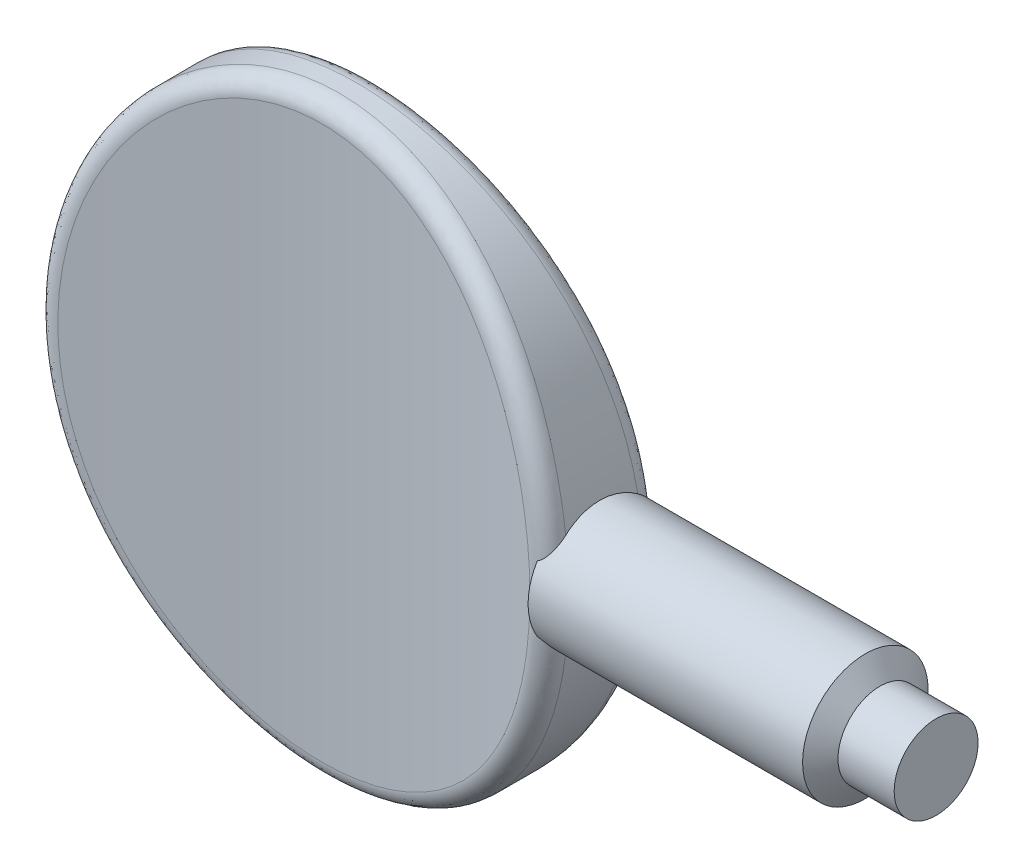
ISO-10303-21;
HEADER;
FILE_DESCRIPTION(('STEP AP214'),'2;1');
FILE_NAME('part.step','',(''),(''),'','','');
FILE_SCHEMA(('AUTOMOTIVE_DESIGN { 1 0 10303 214 1 1 1 1 }'));
ENDSEC;
DATA;
#1=APPLICATION_CONTEXT('core data for automotive mechanical design processes');
#2=APPLICATION_PROTOCOL_DEFINITION('international standard','automotive_design',2000,#1);
#3=PRODUCT_CONTEXT('',#1,'mechanical');
#4=PRODUCT('Part','Part','',(#3));
#5=PRODUCT_RELATED_PRODUCT_CATEGORY('part','',(#4));
#6=PRODUCT_DEFINITION_FORMATION('','',#4);
#7=PRODUCT_DEFINITION_CONTEXT('part definition',#1,'design');
#8=PRODUCT_DEFINITION('design','',#6,#7);
#9=PRODUCT_DEFINITION_SHAPE('','',#8);
#10=(LENGTH_UNIT() NAMED_UNIT(*) SI_UNIT(.MILLI.,.METRE.));
#11=(NAMED_UNIT(*) PLANE_ANGLE_UNIT() SI_UNIT($,.RADIAN.));
#12=(NAMED_UNIT(*) SI_UNIT($,.STERADIAN.) SOLID_ANGLE_UNIT());
#13=UNCERTAINTY_MEASURE_WITH_UNIT(LENGTH_MEASURE(1.E-05),#10,'distance_accuracy_value','');
#14=(GEOMETRIC_REPRESENTATION_CONTEXT(3) GLOBAL_UNCERTAINTY_ASSIGNED_CONTEXT((#13)) GLOBAL_UNIT_ASSIGNED_CONTEXT((#10,
#11,#12)) REPRESENTATION_CONTEXT('',''));
#15=CARTESIAN_POINT('',(0.,0.,0.));
#16=DIRECTION('',(0.,0.,1.));
#17=DIRECTION('',(1.,0.,0.));
#18=AXIS2_PLACEMENT_3D('',#15,#16,#17);
#19=CARTESIAN_POINT('',(0.,0.,2.286));
#20=DIRECTION('',(0.,0.,1.));
#21=DIRECTION('',(0.,-1.,0.));
#22=AXIS2_PLACEMENT_3D('',#19,#20,#21);
#23=ELLIPSE('',#22,11.303,9.906);
#24=DIRECTION('',(0.,0.,-1.));
#25=VECTOR('',#24,1.);
#26=SURFACE_OF_LINEAR_EXTRUSION('',#23,#25);
#27=CARTESIAN_POINT('',(9.7599834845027,-1.93354475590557,1.44359747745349));
#28=CARTESIAN_POINT('',(9.7538599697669,-1.97377990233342,1.3897162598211));
#29=CARTESIAN_POINT('',(9.74788480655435,-2.01176072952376,1.33413671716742));
#30=CARTESIAN_POINT('',(9.73639068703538,-2.08297198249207,1.21996586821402));
#31=CARTESIAN_POINT('',(9.73087174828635,-2.11620222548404,1.1613744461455));
#32=CARTESIAN_POINT('',(9.72044940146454,-2.17767139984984,1.04156116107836));
#33=CARTESIAN_POINT('',(9.71554607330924,-2.20590968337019,0.980338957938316));
#34=CARTESIAN_POINT('',(9.70649644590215,-2.25717945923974,0.855719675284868));
#35=CARTESIAN_POINT('',(9.70235011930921,-2.28021113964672,0.792322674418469));
#36=CARTESIAN_POINT('',(9.69123192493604,-2.34125083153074,0.59939431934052));
#37=CARTESIAN_POINT('',(9.68558076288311,-2.37120394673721,0.46712472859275));
#38=CARTESIAN_POINT('',(9.67850306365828,-2.40853619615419,0.199478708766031));
#39=CARTESIAN_POINT('',(9.67707378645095,-2.4159299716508,0.064104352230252));
#40=CARTESIAN_POINT('',(9.67858617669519,-2.40802787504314,-0.204493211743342));
#41=CARTESIAN_POINT('',(9.68148053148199,-2.39297760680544,-0.33772381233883));
#42=CARTESIAN_POINT('',(9.6912194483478,-2.34108806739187,-0.599771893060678));
#43=CARTESIAN_POINT('',(9.69806554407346,-2.30424033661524,-0.728587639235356));
#44=CARTESIAN_POINT('',(9.7137074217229,-2.21664920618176,-0.960257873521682));
#45=CARTESIAN_POINT('',(9.72208273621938,-2.16865680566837,-1.06418600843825));
#46=CARTESIAN_POINT('',(9.73584734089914,-2.0861466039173,-1.21400793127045));
#47=CARTESIAN_POINT('',(9.74063407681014,-2.05690073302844,-1.26292205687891));
#48=CARTESIAN_POINT('',(9.7505120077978,-1.99503672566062,-1.35854295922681));
#49=CARTESIAN_POINT('',(9.7556032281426,-1.96241830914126,-1.40524955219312));
#50=CARTESIAN_POINT('',(9.76079800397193,-1.92818422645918,-1.45074966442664));
#51=B_SPLINE_CURVE_WITH_KNOTS('',3,(#27,#28,#29,#30,#31,#32,#33,#34,#35,#36,#37,#38,#39,#40,#41,
#42,#43,#44,#45,#46,#47,#48,#49,#50),.UNSPECIFIED.,.F.,.F.,(4,2,2,2,2,2,2,2,2,2,2,4),(0.,
0.202511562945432,0.405030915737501,0.607576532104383,0.810114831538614,1.2151884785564,
1.61999917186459,2.02041242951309,2.42098118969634,2.7640979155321,2.93554569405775,
3.10700772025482),.UNSPECIFIED.);
#52=CARTESIAN_POINT('',(9.75349384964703,-1.97571933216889,1.3853166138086));
#53=VERTEX_POINT('',#52);
#54=CARTESIAN_POINT('',(9.75349384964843,-1.97571933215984,-1.38531661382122));
#55=VERTEX_POINT('',#54);
#56=EDGE_CURVE('E70',#53,#55,#51,.T.);
#57=ORIENTED_EDGE('',*,*,#56,.F.);
#58=CARTESIAN_POINT('',(9.06433649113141,-0.441553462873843,2.07648141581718));
#59=CARTESIAN_POINT('',(9.89731087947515,-0.473374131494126,2.27409385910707));
#60=CARTESIAN_POINT('',(9.8975763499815,-0.466033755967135,1.41744012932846));
#61=CARTESIAN_POINT('',(9.04072988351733,-1.10521542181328,2.07087783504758));
#62=CARTESIAN_POINT('',(9.87118982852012,-1.18437600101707,2.26734926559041));
#63=CARTESIAN_POINT('',(9.87223120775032,-1.16650607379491,1.41173989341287));
#64=CARTESIAN_POINT('',(8.96387282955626,-1.76690913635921,2.05255322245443));
#65=CARTESIAN_POINT('',(9.78656612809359,-1.8914413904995,2.24540170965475));
#66=CARTESIAN_POINT('',(9.78972693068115,-1.86500634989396,1.39309920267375));
#67=CARTESIAN_POINT('',(8.70423897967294,-3.06740809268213,1.9926113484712));
#68=CARTESIAN_POINT('',(9.49942015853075,-3.28368426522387,2.17332598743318));
#69=CARTESIAN_POINT('',(9.5106965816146,-3.23896299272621,1.33212340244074));
#70=CARTESIAN_POINT('',(8.52144099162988,-3.70620872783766,1.95098942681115));
#71=CARTESIAN_POINT('',(9.29855203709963,-3.96503959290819,2.1236030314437));
#72=CARTESIAN_POINT('',(9.3141476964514,-3.9144147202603,1.28978355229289));
#73=CARTESIAN_POINT('',(8.0522372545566,-4.93844637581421,1.84970425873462));
#74=CARTESIAN_POINT('',(8.78113980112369,-5.28032485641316,2.00228764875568));
#75=CARTESIAN_POINT('',(8.8087223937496,-5.21927582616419,1.18675133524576));
#76=CARTESIAN_POINT('',(7.76638400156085,-5.53210522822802,1.79013749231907));
#77=CARTESIAN_POINT('',(8.46783563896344,-5.91194692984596,1.93136369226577));
#78=CARTESIAN_POINT('',(8.50044492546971,-5.84890960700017,1.12615711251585));
#79=CARTESIAN_POINT('',(7.26256698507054,-6.37458445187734,1.69306358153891));
#80=CARTESIAN_POINT('',(7.9123102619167,-6.81102173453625,1.81528163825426));
#81=CARTESIAN_POINT('',(7.95575827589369,-6.74427599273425,1.02740879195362));
#82=CARTESIAN_POINT('',(7.08198860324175,-6.64756129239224,1.65939540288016));
#83=CARTESIAN_POINT('',(7.71435000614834,-7.10090761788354,1.77525192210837));
#84=CARTESIAN_POINT('',(7.76033985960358,-7.03471301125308,0.993159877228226));
#85=CARTESIAN_POINT('',(6.69635721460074,-7.17472703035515,1.59067374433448));
#86=CARTESIAN_POINT('',(7.2916832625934,-7.66016806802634,1.69362011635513));
#87=CARTESIAN_POINT('',(7.34247562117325,-7.59625745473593,0.923252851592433));
#88=CARTESIAN_POINT('',(6.49131885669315,-7.42892702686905,1.55562110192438));
#89=CARTESIAN_POINT('',(7.06731807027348,-7.92959161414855,1.65205176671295));
#90=CARTESIAN_POINT('',(7.12004597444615,-7.86737629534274,0.88759559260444));
#91=CARTESIAN_POINT('',(6.07339660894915,-7.89779481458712,1.48797563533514));
#92=CARTESIAN_POINT('',(6.61001404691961,-8.42614113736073,1.5718945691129));
#93=CARTESIAN_POINT('',(6.66603588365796,-8.36809358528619,0.818783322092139));
#94=CARTESIAN_POINT('',(5.8621693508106,-8.11399325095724,1.45538942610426));
#95=CARTESIAN_POINT('',(6.37923621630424,-8.65490610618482,1.53333835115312));
#96=CARTESIAN_POINT('',(6.43629914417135,-8.59927776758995,0.785635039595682));
#97=CARTESIAN_POINT('',(5.420462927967,-8.52495389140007,1.39126982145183));
#98=CARTESIAN_POINT('',(5.89686229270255,-9.08924875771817,1.45756148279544));
#99=CARTESIAN_POINT('',(5.95522830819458,-9.03927334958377,0.720409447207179));
#100=CARTESIAN_POINT('',(5.18999529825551,-8.71972877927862,1.3597358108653));
#101=CARTESIAN_POINT('',(5.64541451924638,-9.2950474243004,1.42032518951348));
#102=CARTESIAN_POINT('',(5.70390714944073,-9.24809798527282,0.688331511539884));
#103=CARTESIAN_POINT('',(4.7112180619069,-9.08513182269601,1.29889201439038));
#104=CARTESIAN_POINT('',(5.12333296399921,-9.68063953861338,1.34857362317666));
#105=CARTESIAN_POINT('',(5.18108360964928,-9.64035101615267,0.626438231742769));
#106=CARTESIAN_POINT('',(4.46292238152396,-9.25577852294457,1.26958052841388));
#107=CARTESIAN_POINT('',(4.85275176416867,-9.86072624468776,1.31402128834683));
#108=CARTESIAN_POINT('',(4.9095969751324,-9.82379891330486,0.596621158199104));
#109=CARTESIAN_POINT('',(3.95012425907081,-9.5703567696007,1.21433232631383));
#110=CARTESIAN_POINT('',(4.29427737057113,-10.1922417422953,1.2489893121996));
#111=CARTESIAN_POINT('',(4.34815021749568,-10.1623803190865,0.540419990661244));
#112=CARTESIAN_POINT('',(3.68562512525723,-9.71429374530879,1.18839492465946));
#113=CARTESIAN_POINT('',(4.00630404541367,-10.3439928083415,1.21845738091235));
#114=CARTESIAN_POINT('',(4.05819386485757,-10.3175195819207,0.51403519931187));
#115=CARTESIAN_POINT('',(3.18095813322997,-9.95464296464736,1.14434912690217));
#116=CARTESIAN_POINT('',(3.45702558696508,-10.5971097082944,1.1666698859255));
#117=CARTESIAN_POINT('',(3.50428103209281,-10.5768490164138,0.469229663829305));
#118=CARTESIAN_POINT('',(2.94260311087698,-10.0548925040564,1.12565265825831));
#119=CARTESIAN_POINT('',(3.19771589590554,-10.7026948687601,1.14469031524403));
#120=CARTESIAN_POINT('',(3.2424065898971,-10.6851365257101,0.450210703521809));
#121=CARTESIAN_POINT('',(2.45745188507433,-10.2322329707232,1.09221652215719));
#122=CARTESIAN_POINT('',(2.67025548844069,-10.8892399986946,1.10543443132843));
#123=CARTESIAN_POINT('',(2.70890894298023,-10.8768424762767,0.416197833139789));
#124=CARTESIAN_POINT('',(2.21065722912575,-10.3093281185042,1.0774761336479));
#125=CARTESIAN_POINT('',(2.40189348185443,-10.9703962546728,1.08811890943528));
#126=CARTESIAN_POINT('',(2.43728752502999,-10.96026544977,0.401203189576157));
#127=CARTESIAN_POINT('',(1.71091716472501,-10.4390517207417,1.05249286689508));
#128=CARTESIAN_POINT('',(1.85884865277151,-11.1067770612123,1.05881030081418));
#129=CARTESIAN_POINT('',(1.88689681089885,-11.1007143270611,0.375788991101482));
#130=CARTESIAN_POINT('',(1.45797707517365,-10.4917005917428,1.04224623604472));
#131=CARTESIAN_POINT('',(1.58389234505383,-11.1621799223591,1.04677989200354));
#132=CARTESIAN_POINT('',(1.60813368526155,-11.1577622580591,0.365365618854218));
#133=CARTESIAN_POINT('',(0.948114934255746,-10.5716983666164,1.02661952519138));
#134=CARTESIAN_POINT('',(1.03003449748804,-11.2462512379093,1.0284575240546));
#135=CARTESIAN_POINT('',(1.04597206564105,-11.2444700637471,0.349469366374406));
#136=CARTESIAN_POINT('',(0.691193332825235,-10.5990501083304,1.02123889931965));
#137=CARTESIAN_POINT('',(0.75080259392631,-11.2750269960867,1.02214236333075));
#138=CARTESIAN_POINT('',(0.762574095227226,-11.2741330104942,0.343995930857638));
#139=CARTESIAN_POINT('',(0.209209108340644,-10.6261003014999,1.01591573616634));
#140=CARTESIAN_POINT('',(0.227293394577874,-11.3034522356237,1.01590196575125));
#141=CARTESIAN_POINT('',(0.23083451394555,-11.3034697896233,0.338580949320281));
#142=CARTESIAN_POINT('',(-0.0156831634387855,-10.6289136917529,1.0153606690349));
#143=CARTESIAN_POINT('',(-0.0170749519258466,-11.3064105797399,1.01525084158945));
#144=CARTESIAN_POINT('',(-0.0173081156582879,-11.3065216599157,0.338016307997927));
#145=CARTESIAN_POINT('',(-0.464932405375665,-10.6149527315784,1.01810993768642));
#146=CARTESIAN_POINT('',(-0.504998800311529,-11.2917412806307,1.0184735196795));
#147=CARTESIAN_POINT('',(-0.512964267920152,-11.291379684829,0.340812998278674));
#148=CARTESIAN_POINT('',(-0.689289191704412,-10.5981724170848,1.02141544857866));
#149=CARTESIAN_POINT('',(-0.748793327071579,-11.274092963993,1.02235186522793));
#150=CARTESIAN_POINT('',(-0.760477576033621,-11.2731793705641,0.344175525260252));
#151=CARTESIAN_POINT('',(-1.13556884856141,-10.5452601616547,1.0317883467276));
#152=CARTESIAN_POINT('',(-1.2335417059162,-11.2184912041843,1.03451259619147));
#153=CARTESIAN_POINT('',(-1.2526768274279,-11.2158123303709,0.354727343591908));
#154=CARTESIAN_POINT('',(-1.35749296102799,-10.5091386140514,1.03885371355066));
#155=CARTESIAN_POINT('',(-1.47472448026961,-11.1804953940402,1.04280421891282));
#156=CARTESIAN_POINT('',(-1.49736421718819,-11.1766568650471,0.361914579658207));
#157=CARTESIAN_POINT('',(-1.79749977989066,-10.4180266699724,1.05654330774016));
#158=CARTESIAN_POINT('',(-1.9527689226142,-11.0847276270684,1.06355029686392));
#159=CARTESIAN_POINT('',(-1.98226996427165,-11.0779503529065,0.379909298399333));
#160=CARTESIAN_POINT('',(-2.01558099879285,-10.3630291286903,1.06716888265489));
#161=CARTESIAN_POINT('',(-2.18983193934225,-11.0268610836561,1.07602492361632));
#162=CARTESIAN_POINT('',(-2.22248659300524,-11.0183915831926,0.390718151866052));
#163=CARTESIAN_POINT('',(-2.44049679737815,-10.2366111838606,1.09134888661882));
#164=CARTESIAN_POINT('',(-2.65162302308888,-10.8939375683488,1.10439715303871));
#165=CARTESIAN_POINT('',(-2.69022849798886,-10.8815920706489,0.415315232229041));
#166=CARTESIAN_POINT('',(-2.64747600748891,-10.1656759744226,1.10481618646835));
#167=CARTESIAN_POINT('',(-2.87668834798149,-10.8192776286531,1.12021587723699));
#168=CARTESIAN_POINT('',(-2.91792129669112,-10.8048739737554,0.429014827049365));
#169=CARTESIAN_POINT('',(-3.05512217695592,-10.0074393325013,1.13449174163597));
#170=CARTESIAN_POINT('',(-3.31994587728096,-10.6528031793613,1.15506402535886));
#171=CARTESIAN_POINT('',(-3.36602555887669,-10.6338821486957,0.459202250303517));
#172=CARTESIAN_POINT('',(-3.25578691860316,-9.92013222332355,1.15070094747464));
#173=CARTESIAN_POINT('',(-3.53825524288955,-10.5608636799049,1.17411805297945));
#174=CARTESIAN_POINT('',(-3.58643446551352,-10.5396023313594,0.47569104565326));
#175=CARTESIAN_POINT('',(-3.84654426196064,-9.63504101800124,1.20285461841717));
#176=CARTESIAN_POINT('',(-4.18237180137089,-10.2600882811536,1.2355487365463));
#177=CARTESIAN_POINT('',(-4.23476308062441,-10.2320328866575,0.528744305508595));
#178=CARTESIAN_POINT('',(-4.22571339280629,-9.41399224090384,1.24234388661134));
#179=CARTESIAN_POINT('',(-4.59539551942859,-10.0267310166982,1.28209163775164));
#180=CARTESIAN_POINT('',(-4.65012975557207,-9.99391046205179,0.568914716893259));
#181=CARTESIAN_POINT('',(-4.97579964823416,-8.89885031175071,1.3305459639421));
#182=CARTESIAN_POINT('',(-5.41315254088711,-9.48328684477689,1.38604753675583));
#183=CARTESIAN_POINT('',(-5.4703040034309,-9.44018886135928,0.658638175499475));
#184=CARTESIAN_POINT('',(-5.34372659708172,-8.60038202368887,1.37973973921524));
#185=CARTESIAN_POINT('',(-5.81438792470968,-9.16774150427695,1.44414433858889));
#186=CARTESIAN_POINT('',(-5.87171654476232,-9.11997166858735,0.708680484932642));
#187=CARTESIAN_POINT('',(-6.03184666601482,-7.95150761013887,1.4804681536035));
#188=CARTESIAN_POINT('',(-6.56597991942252,-8.48184990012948,1.56320931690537));
#189=CARTESIAN_POINT('',(-6.62102535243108,-8.42537982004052,0.811146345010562));
#190=CARTESIAN_POINT('',(-6.35201943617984,-7.60107946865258,1.53200377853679));
#191=CARTESIAN_POINT('',(-6.91576322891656,-8.11070576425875,1.62422932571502));
#192=CARTESIAN_POINT('',(-6.96889880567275,-8.05098220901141,0.863570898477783));
#193=CARTESIAN_POINT('',(-6.97998081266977,-6.80920807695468,1.63984325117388));
#194=CARTESIAN_POINT('',(-7.60405609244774,-7.27066586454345,1.75228632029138));
#195=CARTESIAN_POINT('',(-7.65003938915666,-7.20661845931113,0.973270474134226));
#196=CARTESIAN_POINT('',(-7.28060968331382,-6.36185596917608,1.69588343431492));
#197=CARTESIAN_POINT('',(-7.93313272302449,-6.79574608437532,1.81884441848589));
#198=CARTESIAN_POINT('',(-7.97537608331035,-6.73055907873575,1.03027728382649));
#199=CARTESIAN_POINT('',(-7.81370754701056,-5.42598150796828,1.8002849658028));
#200=CARTESIAN_POINT('',(-8.51893240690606,-5.80032940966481,1.94329479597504));
#201=CARTESIAN_POINT('',(-8.55143234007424,-5.73641613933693,1.13647961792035));
#202=CARTESIAN_POINT('',(-8.04612685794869,-4.93742947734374,1.84864070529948));
#203=CARTESIAN_POINT('',(-8.77401400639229,-5.2803139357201,2.00093018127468));
#204=CARTESIAN_POINT('',(-8.80209751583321,-5.21830229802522,1.18566943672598));
#205=CARTESIAN_POINT('',(-8.46579777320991,-3.86798278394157,1.93874221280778));
#206=CARTESIAN_POINT('',(-9.23695256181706,-4.13843974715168,2.10886875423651));
#207=CARTESIAN_POINT('',(-9.25424841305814,-4.08562792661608,1.27732508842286));
#208=CARTESIAN_POINT('',(-8.6437754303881,-3.28317788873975,1.97890682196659));
#209=CARTESIAN_POINT('',(-9.43263150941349,-3.5145810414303,2.15687234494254));
#210=CARTESIAN_POINT('',(-9.4456739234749,-3.46710594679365,1.31818248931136));
#211=CARTESIAN_POINT('',(-8.90988228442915,-2.09221318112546,2.03992221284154));
#212=CARTESIAN_POINT('',(-9.72684753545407,-2.24001917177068,2.2302091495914));
#213=CARTESIAN_POINT('',(-9.73173019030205,-2.20856660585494,1.38025032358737));
#214=CARTESIAN_POINT('',(-8.99807319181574,-1.48606833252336,2.06078625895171));
#215=CARTESIAN_POINT('',(-9.82401541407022,-1.59219662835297,2.25521159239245));
#216=CARTESIAN_POINT('',(-9.82642742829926,-1.56856432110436,1.40147425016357));
#217=CARTESIAN_POINT('',(-9.07155097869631,-0.448175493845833,2.07818799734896));
#218=CARTESIAN_POINT('',(-9.90531304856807,-0.480096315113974,2.27615280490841));
#219=CARTESIAN_POINT('',(-9.9053231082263,-0.472998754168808,1.41917614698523));
#220=CARTESIAN_POINT('',(-9.07960069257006,-0.0180241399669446,2.08010539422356));
#221=CARTESIAN_POINT('',(-9.91421749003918,-0.0195018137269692,2.2784597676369));
#222=CARTESIAN_POINT('',(-9.91396460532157,-0.0190320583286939,1.42112661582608));
#223=CARTESIAN_POINT('',(-9.05114135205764,0.840874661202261,2.07334832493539));
#224=CARTESIAN_POINT('',(-9.8827087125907,0.901272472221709,2.27032260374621));
#225=CARTESIAN_POINT('',(-9.88340958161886,0.887501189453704,1.41425299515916));
#226=CARTESIAN_POINT('',(-9.01462354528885,1.26962181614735,2.06467177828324));
#227=CARTESIAN_POINT('',(-9.84236732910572,1.36026082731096,2.25989703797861));
#228=CARTESIAN_POINT('',(-9.84420366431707,1.34006744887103,1.40542678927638));
#229=CARTESIAN_POINT('',(-8.90937536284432,2.0316986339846,2.0400225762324));
#230=CARTESIAN_POINT('',(-9.72583784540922,2.17696234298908,2.23022004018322));
#231=CARTESIAN_POINT('',(-9.73114985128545,2.14477756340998,1.38035241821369));
#232=CARTESIAN_POINT('',(-8.8489354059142,2.3663077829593,2.02594526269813));
#233=CARTESIAN_POINT('',(-9.65907544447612,2.53501090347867,2.21331194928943));
#234=CARTESIAN_POINT('',(-9.66621476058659,2.49821035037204,1.3660322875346));
#235=CARTESIAN_POINT('',(-8.70028670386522,3.02889346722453,1.99186677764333));
#236=CARTESIAN_POINT('',(-9.49474440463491,3.24406808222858,2.17235903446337));
#237=CARTESIAN_POINT('',(-9.50642120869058,3.19839647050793,1.33136598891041));
#238=CARTESIAN_POINT('',(-8.61207087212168,3.35686828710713,1.97186409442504));
#239=CARTESIAN_POINT('',(-9.39741618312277,3.59458478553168,2.14837201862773));
#240=CARTESIAN_POINT('',(-9.41155511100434,3.54514807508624,1.31101828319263));
#241=CARTESIAN_POINT('',(-8.40792982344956,4.00383954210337,1.92654702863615));
#242=CARTESIAN_POINT('',(-9.17207272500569,4.28589025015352,2.09402079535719));
#243=CARTESIAN_POINT('',(-9.19186339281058,4.22959703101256,1.26491955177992));
#244=CARTESIAN_POINT('',(-8.29197010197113,4.32282423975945,1.90122603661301));
#245=CARTESIAN_POINT('',(-9.04433751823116,4.62626387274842,2.06371975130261));
#246=CARTESIAN_POINT('',(-9.06700046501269,4.56728252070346,1.2391618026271));
#247=CARTESIAN_POINT('',(-8.03266921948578,4.94864016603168,1.84612445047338));
#248=CARTESIAN_POINT('',(-8.75862164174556,5.29375063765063,1.9977928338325));
#249=CARTESIAN_POINT('',(-8.7875357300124,5.23032676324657,1.18310977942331));
#250=CARTESIAN_POINT('',(-7.88933080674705,5.25547261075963,1.8163443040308));
#251=CARTESIAN_POINT('',(-8.60101160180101,5.6205680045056,1.96224124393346));
#252=CARTESIAN_POINT('',(-8.63293690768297,5.55568674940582,1.1528159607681));
#253=CARTESIAN_POINT('',(-7.5827057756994,5.84065532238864,1.75476032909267));
#254=CARTESIAN_POINT('',(-8.26377031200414,6.24355498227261,1.88874534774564));
#255=CARTESIAN_POINT('',(-8.30186425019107,6.1768129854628,1.09016973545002));
#256=CARTESIAN_POINT('',(-7.42060725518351,6.11966595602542,1.72310789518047));
#257=CARTESIAN_POINT('',(-8.08585157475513,6.54018510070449,1.85105198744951));
#258=CARTESIAN_POINT('',(-8.12668803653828,6.47325210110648,1.05797133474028));
#259=CARTESIAN_POINT('',(-7.07231803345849,6.66122664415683,1.65771330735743));
#260=CARTESIAN_POINT('',(-7.70361694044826,7.11546435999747,1.77323427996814));
#261=CARTESIAN_POINT('',(-7.74985395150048,7.04926217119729,0.991448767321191));
#262=CARTESIAN_POINT('',(-6.88614017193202,6.92378536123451,1.62397227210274));
#263=CARTESIAN_POINT('',(-7.49964582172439,7.39408379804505,1.73315517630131));
#264=CARTESIAN_POINT('',(-7.54821019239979,7.3288419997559,0.957125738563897));
#265=CARTESIAN_POINT('',(-6.49029818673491,7.42975304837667,1.55555294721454));
#266=CARTESIAN_POINT('',(-7.06608461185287,7.93046508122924,1.65196090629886));
#267=CARTESIAN_POINT('',(-7.11892134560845,7.86825729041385,0.887526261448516));
#268=CARTESIAN_POINT('',(-6.2806366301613,7.67316410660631,1.52087476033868));
#269=CARTESIAN_POINT('',(-6.83678956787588,8.1883058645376,1.6108692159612));
#270=CARTESIAN_POINT('',(-6.89127909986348,8.12809490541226,0.852249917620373));
#271=CARTESIAN_POINT('',(-5.8388607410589,8.13772708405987,1.45187677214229));
#272=CARTESIAN_POINT('',(-6.35382230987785,8.67984460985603,1.52920305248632));
#273=CARTESIAN_POINT('',(-6.41093575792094,8.624649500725,0.782061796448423));
#274=CARTESIAN_POINT('',(-5.60676139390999,8.35889366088,1.417556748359));
#275=CARTESIAN_POINT('',(-6.10038934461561,8.91374416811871,1.48862685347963));
#276=CARTESIAN_POINT('',(-6.15825138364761,8.86138170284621,0.747149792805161));
#277=CARTESIAN_POINT('',(-5.14547789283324,8.75521824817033,1.35394959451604));
#278=CARTESIAN_POINT('',(-5.59675257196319,9.33250836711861,1.41349407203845));
#279=CARTESIAN_POINT('',(-5.65531654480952,9.28616485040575,0.68244549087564));
#280=CARTESIAN_POINT('',(-4.91829844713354,8.9327643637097,1.32450134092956));
#281=CARTESIAN_POINT('',(-5.34900946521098,9.5200007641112,1.37874615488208));
#282=CARTESIAN_POINT('',(-5.40732214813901,9.47671576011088,0.652489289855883));
#283=CARTESIAN_POINT('',(-4.44814344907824,9.26490654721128,1.26802841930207));
#284=CARTESIAN_POINT('',(-4.8365814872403,9.87031362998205,1.31219664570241));
#285=CARTESIAN_POINT('',(-4.89341430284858,9.833611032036,0.595042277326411));
#286=CARTESIAN_POINT('',(-4.20517788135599,9.41951692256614,1.24100224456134));
#287=CARTESIAN_POINT('',(-4.57190339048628,10.0334050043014,1.28035681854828));
#288=CARTESIAN_POINT('',(-4.62751217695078,9.99997048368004,0.56754993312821));
#289=CARTESIAN_POINT('',(-3.7052575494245,9.7034163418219,1.1903933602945));
#290=CARTESIAN_POINT('',(-4.02765051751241,10.332475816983,1.22081747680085));
#291=CARTESIAN_POINT('',(-4.07971355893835,10.3057842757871,0.516068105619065));
#292=CARTESIAN_POINT('',(-3.44831525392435,9.83272749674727,1.16680764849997));
#293=CARTESIAN_POINT('',(-3.74797965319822,10.4687607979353,1.19306613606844));
#294=CARTESIAN_POINT('',(-3.79783131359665,10.4452621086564,0.492075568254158));
#295=CARTESIAN_POINT('',(-2.92242796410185,10.0639380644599,1.12400959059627));
#296=CARTESIAN_POINT('',(-3.17597688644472,10.7120881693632,1.14278503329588));
#297=CARTESIAN_POINT('',(-3.22025584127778,10.6948915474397,0.448539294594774));
#298=CARTESIAN_POINT('',(-2.65348535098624,10.1658428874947,1.10479638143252));
#299=CARTESIAN_POINT('',(-2.88342317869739,10.8194170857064,1.12020062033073));
#300=CARTESIAN_POINT('',(-2.92456535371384,10.8050489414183,0.428994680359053));
#301=CARTESIAN_POINT('',(-2.14710069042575,10.3272733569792,1.07404899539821));
#302=CARTESIAN_POINT('',(-2.33284413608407,10.9892348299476,1.08410380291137));
#303=CARTESIAN_POINT('',(-2.36731608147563,10.9796823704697,0.39771693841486));
#304=CARTESIAN_POINT('',(-1.91094499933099,10.3908533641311,1.06179682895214));
#305=CARTESIAN_POINT('',(-2.0761007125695,11.0561454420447,1.06971620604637));
#306=CARTESIAN_POINT('',(-2.10724644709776,11.0485217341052,0.385253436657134));
#307=CARTESIAN_POINT('',(-1.43374613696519,10.4958098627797,1.04145662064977));
#308=CARTESIAN_POINT('',(-1.55762642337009,11.1664699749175,1.04586002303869));
#309=CARTESIAN_POINT('',(-1.5814284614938,11.162210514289,0.364562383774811));
#310=CARTESIAN_POINT('',(-1.1927036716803,10.5371895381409,1.03336798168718));
#311=CARTESIAN_POINT('',(-1.295640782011,11.2100047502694,1.03636574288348));
#312=CARTESIAN_POINT('',(-1.31568093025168,11.2070633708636,0.356334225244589));
#313=CARTESIAN_POINT('',(-0.707915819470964,10.5970726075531,1.02163323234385));
#314=CARTESIAN_POINT('',(-0.769059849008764,11.2729324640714,1.02260821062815));
#315=CARTESIAN_POINT('',(-0.781028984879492,11.2719859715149,0.344397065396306));
#316=CARTESIAN_POINT('',(-0.464172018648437,10.6155887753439,1.01798464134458));
#317=CARTESIAN_POINT('',(-0.504175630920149,11.2924099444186,1.01832657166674));
#318=CARTESIAN_POINT('',(-0.512126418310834,11.2920695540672,0.340685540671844));
#319=CARTESIAN_POINT('',(0.0239742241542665,10.6294808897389,1.01524901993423));
#320=CARTESIAN_POINT('',(0.0259922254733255,11.3070062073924,1.01512004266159));
#321=CARTESIAN_POINT('',(0.0264470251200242,11.3071368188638,0.337902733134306));
#322=CARTESIAN_POINT('',(0.268376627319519,10.6248581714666,1.01616172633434));
#323=CARTESIAN_POINT('',(0.291583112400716,11.3021433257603,1.01619112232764));
#324=CARTESIAN_POINT('',(0.296117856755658,11.3021219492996,0.338831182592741));
#325=CARTESIAN_POINT('',(0.731015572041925,10.5941897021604,1.02219342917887));
#326=CARTESIAN_POINT('',(0.794042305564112,11.2699210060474,1.02326107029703));
#327=CARTESIAN_POINT('',(0.806497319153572,11.2688626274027,0.344966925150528));
#328=CARTESIAN_POINT('',(0.949402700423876,10.5703538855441,1.02687846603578));
#329=CARTESIAN_POINT('',(1.03135419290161,11.244851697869,1.02875824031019));
#330=CARTESIAN_POINT('',(1.04738130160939,11.2430144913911,0.34973277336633));
#331=CARTESIAN_POINT('',(1.38344630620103,10.5043595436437,1.03977653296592));
#332=CARTESIAN_POINT('',(1.50284665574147,11.1754967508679,1.04388124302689));
#333=CARTESIAN_POINT('',(1.52596681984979,11.1714816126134,0.362853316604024));
#334=CARTESIAN_POINT('',(1.59910191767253,10.4621953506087,1.04799065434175));
#335=CARTESIAN_POINT('',(1.73723082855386,11.1311427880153,1.053521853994));
#336=CARTESIAN_POINT('',(1.76366734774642,11.1257907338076,0.371209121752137));
#337=CARTESIAN_POINT('',(2.02606245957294,10.3600924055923,1.06772057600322));
#338=CARTESIAN_POINT('',(2.20115032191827,11.0238097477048,1.07666464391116));
#339=CARTESIAN_POINT('',(2.23402228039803,11.0152178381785,0.39127936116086));
#340=CARTESIAN_POINT('',(2.23736912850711,10.3001609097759,1.0792350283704));
#341=CARTESIAN_POINT('',(2.43086687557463,10.9607473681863,1.09018446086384));
#342=CARTESIAN_POINT('',(2.46667870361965,10.9503436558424,0.402992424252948));
#343=CARTESIAN_POINT('',(2.65441619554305,10.1632551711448,1.10525920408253));
#344=CARTESIAN_POINT('',(2.88420079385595,10.8167652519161,1.12072955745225));
#345=CARTESIAN_POINT('',(2.92555248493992,10.8022616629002,0.429465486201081));
#346=CARTESIAN_POINT('',(2.86015443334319,10.0862744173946,1.11977007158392));
#347=CARTESIAN_POINT('',(3.10796098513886,10.7357272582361,1.13777888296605));
#348=CARTESIAN_POINT('',(3.15176734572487,10.7190468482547,0.444226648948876));
#349=CARTESIAN_POINT('',(3.47229190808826,9.82882926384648,1.16766697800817));
#350=CARTESIAN_POINT('',(3.77502068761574,10.4642750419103,1.19415299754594));
#351=CARTESIAN_POINT('',(3.82428787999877,10.4410018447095,0.492949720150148));
#352=CARTESIAN_POINT('',(3.8683972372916,9.62312725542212,1.20516354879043));
#353=CARTESIAN_POINT('',(4.20637914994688,10.2471702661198,1.23832898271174));
#354=CARTESIAN_POINT('',(4.25872054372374,10.2191448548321,0.531093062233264));
#355=CARTESIAN_POINT('',(4.62459293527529,9.15366768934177,1.28740400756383));
#356=CARTESIAN_POINT('',(5.03001761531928,9.75240293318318,1.33514205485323));
#357=CARTESIAN_POINT('',(5.08654839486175,9.71393277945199,0.614752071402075));
#358=CARTESIAN_POINT('',(4.9846713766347,8.88989099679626,1.33215028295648));
#359=CARTESIAN_POINT('',(5.42252640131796,9.47370233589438,1.38794594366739));
#360=CARTESIAN_POINT('',(5.47992999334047,9.43055742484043,0.660270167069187));
#361=CARTESIAN_POINT('',(5.69889695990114,8.28317315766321,1.42989181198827));
#362=CARTESIAN_POINT('',(6.20241802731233,8.83257556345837,1.50340477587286));
#363=CARTESIAN_POINT('',(6.25876561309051,8.78017530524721,0.759697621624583));
#364=CARTESIAN_POINT('',(6.04858866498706,7.93486893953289,1.48326169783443));
#365=CARTESIAN_POINT('',(6.5841873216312,8.46389482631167,1.56654004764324));
#366=CARTESIAN_POINT('',(6.63920256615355,8.40755316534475,0.813988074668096));
#367=CARTESIAN_POINT('',(6.69355774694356,7.18955442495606,1.58930188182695));
#368=CARTESIAN_POINT('',(7.28996031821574,7.6745484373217,1.69221318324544));
#369=CARTESIAN_POINT('',(7.33958984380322,7.61192292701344,0.921857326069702));
#370=CARTESIAN_POINT('',(6.98880792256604,6.79251994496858,1.64197181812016));
#371=CARTESIAN_POINT('',(7.61298151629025,7.25337948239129,1.7547092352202));
#372=CARTESIAN_POINT('',(7.65950993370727,7.18888981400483,0.975435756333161));
#373=CARTESIAN_POINT('',(7.55852416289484,5.9035257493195,1.74907555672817));
#374=CARTESIAN_POINT('',(8.23879298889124,6.30821299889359,1.88227557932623));
#375=CARTESIAN_POINT('',(8.27589606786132,6.24338332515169,1.08438690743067));
#376=CARTESIAN_POINT('',(7.82473612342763,5.40599546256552,1.80277922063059));
#377=CARTESIAN_POINT('',(8.53065041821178,5.77912309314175,1.94620221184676));
#378=CARTESIAN_POINT('',(8.56329170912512,5.71520536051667,1.13901689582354));
#379=CARTESIAN_POINT('',(8.2814684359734,4.37513696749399,1.89847802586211));
#380=CARTESIAN_POINT('',(9.03367283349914,4.68015804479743,2.06063032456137));
#381=CARTESIAN_POINT('',(9.0557691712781,4.62251452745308,1.23636639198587));
#382=CARTESIAN_POINT('',(8.47195257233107,3.84179177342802,1.94046756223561));
#383=CARTESIAN_POINT('',(9.24305355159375,4.11150478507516,2.11078670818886));
#384=CARTESIAN_POINT('',(9.26081160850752,4.05798442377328,1.27908019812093));
#385=CARTESIAN_POINT('',(8.79277988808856,2.69157447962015,2.01267902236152));
#386=CARTESIAN_POINT('',(9.59762062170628,2.88109997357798,2.19751575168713));
#387=CARTESIAN_POINT('',(9.60591371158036,2.8417227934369,1.35253722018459));
#388=CARTESIAN_POINT('',(8.91415781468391,2.07198286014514,2.04108919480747));
#389=CARTESIAN_POINT('',(9.7312231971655,2.21931200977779,2.23152481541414));
#390=CARTESIAN_POINT('',(9.73629583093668,2.1872462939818,1.38143743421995));
#391=CARTESIAN_POINT('',(9.06115860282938,0.820487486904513,2.07565423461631));
#392=CARTESIAN_POINT('',(9.89394740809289,0.878268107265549,2.27313745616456));
#393=CARTESIAN_POINT('',(9.89417614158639,0.8659119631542,1.41659868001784));
#394=CARTESIAN_POINT('',(9.08675047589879,0.188579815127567,2.08180189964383));
#395=CARTESIAN_POINT('',(9.92214545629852,0.202610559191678,2.28050627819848));
#396=CARTESIAN_POINT('',(9.92164103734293,0.199050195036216,1.42285238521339));
#397=CARTESIAN_POINT('',(9.06433649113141,-0.441553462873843,2.07648141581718));
#398=CARTESIAN_POINT('',(9.89731087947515,-0.473374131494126,2.27409385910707));
#399=CARTESIAN_POINT('',(9.8975763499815,-0.466033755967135,1.41744012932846));
#400=(BOUNDED_SURFACE() B_SPLINE_SURFACE(3,2,((#58,#59,#60),(#61,#62,#63),(#64,#65,#66),(#67,
#68,#69),(#70,#71,#72),(#73,#74,#75),(#76,#77,#78),(#79,#80,#81),(#82,#83,#84),(#85,#86,#87),
(#88,#89,#90),(#91,#92,#93),(#94,#95,#96),(#97,#98,#99),(#100,#101,#102),(#103,#104,#105),(#106,
#107,#108),(#109,#110,#111),(#112,#113,#114),(#115,#116,#117),(#118,#119,#120),(#121,#122,#123),
(#124,#125,#126),(#127,#128,#129),(#130,#131,#132),(#133,#134,#135),(#136,#137,#138),(#139,#140,
#141),(#142,#143,#144),(#145,#146,#147),(#148,#149,#150),(#151,#152,#153),(#154,#155,#156),
(#157,#158,#159),(#160,#161,#162),(#163,#164,#165),(#166,#167,#168),(#169,#170,#171),(#172,#173,
#174),(#175,#176,#177),(#178,#179,#180),(#181,#182,#183),(#184,#185,#186),(#187,#188,#189),
(#190,#191,#192),(#193,#194,#195),(#196,#197,#198),(#199,#200,#201),(#202,#203,#204),(#205,#206,
#207),(#208,#209,#210),(#211,#212,#213),(#214,#215,#216),(#217,#218,#219),(#220,#221,#222),
(#223,#224,#225),(#226,#227,#228),(#229,#230,#231),(#232,#233,#234),(#235,#236,#237),(#238,#239,
#240),(#241,#242,#243),(#244,#245,#246),(#247,#248,#249),(#250,#251,#252),(#253,#254,#255),
(#256,#257,#258),(#259,#260,#261),(#262,#263,#264),(#265,#266,#267),(#268,#269,#270),(#271,#272,
#273),(#274,#275,#276),(#277,#278,#279),(#280,#281,#282),(#283,#284,#285),(#286,#287,#288),
(#289,#290,#291),(#292,#293,#294),(#295,#296,#297),(#298,#299,#300),(#301,#302,#303),(#304,#305,
#306),(#307,#308,#309),(#310,#311,#312),(#313,#314,#315),(#316,#317,#318),(#319,#320,#321),
(#322,#323,#324),(#325,#326,#327),(#328,#329,#330),(#331,#332,#333),(#334,#335,#336),(#337,#338,
#339),(#340,#341,#342),(#343,#344,#345),(#346,#347,#348),(#349,#350,#351),(#352,#353,#354),
(#355,#356,#357),(#358,#359,#360),(#361,#362,#363),(#364,#365,#366),(#367,#368,#369),(#370,#371,
#372),(#373,#374,#375),(#376,#377,#378),(#379,#380,#381),(#382,#383,#384),(#385,#386,#387),
(#388,#389,#390),(#391,#392,#393),(#394,#395,#396),(#397,#398,#399)),.UNSPECIFIED.,.T.,.F.,
.F.) B_SPLINE_SURFACE_WITH_KNOTS((4,2,2,2,2,2,2,2,2,2,2,2,2,2,2,2,2,2,2,2,2,2,2,2,2,2,2,2,2,2,2,
2,2,2,2,2,2,2,2,2,2,2,2,2,2,2,2,2,2,2,2,2,2,2,2,2,4),(3,3),(0.,1.99013383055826,
3.98066589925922,5.9606813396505,6.95189992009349,7.94252781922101,8.86106937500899,
9.77906414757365,10.6963494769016,11.6134481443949,12.4015093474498,13.1894268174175,
13.9766850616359,14.7638549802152,15.4493720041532,16.135097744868,16.8204553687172,
17.5060726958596,18.1731188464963,18.8403967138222,20.1739641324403,21.6123317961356,
23.0513106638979,24.6794364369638,26.3087451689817,28.1416611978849,29.9733166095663,
31.2617105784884,32.5503576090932,33.5706861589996,34.5912752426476,35.6131402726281,
36.6349027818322,37.6106807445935,38.5859405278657,39.5610938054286,40.5356002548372,
41.4132125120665,42.2902749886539,43.1665674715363,44.0426868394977,44.7880998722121,
45.5334059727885,46.2782954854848,47.0231420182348,47.6927906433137,48.3626464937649,
49.0322291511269,49.7020679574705,51.0579388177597,52.4142570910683,53.9106893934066,
55.4078673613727,57.1081651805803,58.8092751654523,60.6982549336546,62.5878457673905),(0.,1.),
.UNSPECIFIED.) GEOMETRIC_REPRESENTATION_ITEM() RATIONAL_B_SPLINE_SURFACE(((1.,0.620209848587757,
1.),(1.,0.620635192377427,1.),(1.,0.622024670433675,1.),(1.,0.626603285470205,1.),(1.,
0.629792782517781,1.),(1.,0.637645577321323,1.),(1.,0.642300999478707,1.),(1.,0.650003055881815,
1.),(1.,0.652692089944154,1.),(1.,0.658224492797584,1.),(1.,0.661067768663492,1.),(1.,
0.666601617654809,1.),(1.,0.669288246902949,1.),(1.,0.674617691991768,1.),(1.,0.677260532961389,
1.),(1.,0.682400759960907,1.),(1.,0.684898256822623,1.),(1.,0.689641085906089,1.),(1.,
0.691886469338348,1.),(1.,0.69572436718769,1.),(1.,0.697364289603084,1.),(1.,0.700310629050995,
1.),(1.,0.701617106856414,1.),(1.,0.703838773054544,1.),(1.,0.704754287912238,1.),(1.,
0.706152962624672,1.),(1.,0.706636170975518,1.),(1.,0.707114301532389,1.),(1.,0.707164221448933,
1.),(1.,0.706917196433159,1.),(1.,0.706620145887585,1.),(1.,0.705690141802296,1.),(1.,
0.705057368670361,1.),(1.,0.703478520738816,1.),(1.,0.702532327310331,1.),(1.,0.700388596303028,
1.),(1.,0.699198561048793,1.),(1.,0.69658926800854,1.),(1.,0.695169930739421,1.),(1.,
0.690628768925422,1.),(1.,0.687222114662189,1.),(1.,0.679710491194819,1.),(1.,0.675571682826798,
1.),(1.,0.667208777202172,1.),(1.,0.662984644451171,1.),(1.,0.654247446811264,1.),(1.,
0.649769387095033,1.),(1.,0.641511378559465,1.),(1.,0.637731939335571,1.),(1.,0.630738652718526,
1.),(1.,0.627654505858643,1.),(1.,0.62298655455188,1.),(1.,0.621401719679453,1.),(1.,
0.620080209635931,1.),(1.,0.619934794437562,1.),(1.,0.620447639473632,1.),(1.,0.621106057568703,
1.),(1.,0.622982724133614,1.),(1.,0.624055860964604,1.),(1.,0.62666300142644,1.),(1.,
0.628197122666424,1.),(1.,0.63168899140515,1.),(1.,0.633647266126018,1.),(1.,0.637933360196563,
1.),(1.,0.640261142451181,1.),(1.,0.645107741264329,1.),(1.,0.647613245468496,1.),(1.,
0.652827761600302,1.),(1.,0.655536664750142,1.),(1.,0.661073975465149,1.),(1.,0.663902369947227,
1.),(1.,0.669577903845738,1.),(1.,0.672425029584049,1.),(1.,0.677747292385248,1.),(1.,
0.68023126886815,1.),(1.,0.685030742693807,1.),(1.,0.687346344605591,1.),(1.,0.691712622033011,
1.),(1.,0.693763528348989,1.),(1.,0.697507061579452,1.),(1.,0.699199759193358,1.),(1.,
0.701920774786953,1.),(1.,0.703010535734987,1.),(1.,0.70482443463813,1.),(1.,0.705548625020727,
1.),(1.,0.706600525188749,1.),(1.,0.706928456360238,1.),(1.,0.707174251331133,1.),(1.,
0.707092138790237,1.),(1.,0.706550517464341,1.),(1.,0.706129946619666,1.),(1.,0.704975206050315,
1.),(1.,0.704240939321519,1.),(1.,0.702483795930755,1.),(1.,0.701461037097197,1.),(1.,
0.699159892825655,1.),(1.,0.697881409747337,1.),(1.,0.693683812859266,1.),(1.,0.690425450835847,
1.),(1.,0.683371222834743,1.),(1.,0.679575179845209,1.),(1.,0.671389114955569,1.),(1.,
0.666978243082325,1.),(1.,0.658324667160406,1.),(1.,0.654082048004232,1.),(1.,0.645543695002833,
1.),(1.,0.641318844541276,1.),(1.,0.633852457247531,1.),(1.,0.630611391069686,1.),(1.,
0.625064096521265,1.),(1.,0.622900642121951,1.),(1.,0.620271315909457,1.),(1.,0.619805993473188,
1.),(1.,0.620209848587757,1.))) REPRESENTATION_ITEM('') SURFACE());
#401=CARTESIAN_POINT('',(9.8975763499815,-0.466033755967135,1.41744012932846));
#402=CARTESIAN_POINT('',(9.87223120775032,-1.16650607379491,1.41173989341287));
#403=CARTESIAN_POINT('',(9.78972693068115,-1.86500634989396,1.39309920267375));
#404=CARTESIAN_POINT('',(9.5106965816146,-3.23896299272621,1.33212340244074));
#405=CARTESIAN_POINT('',(9.3141476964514,-3.9144147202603,1.28978355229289));
#406=CARTESIAN_POINT('',(8.8087223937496,-5.21927582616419,1.18675133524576));
#407=CARTESIAN_POINT('',(8.50044492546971,-5.84890960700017,1.12615711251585));
#408=CARTESIAN_POINT('',(7.95575827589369,-6.74427599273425,1.02740879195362));
#409=CARTESIAN_POINT('',(7.76033985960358,-7.03471301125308,0.993159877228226));
#410=CARTESIAN_POINT('',(7.34247562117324,-7.59625745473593,0.923252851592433));
#411=CARTESIAN_POINT('',(7.12004597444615,-7.86737629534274,0.88759559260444));
#412=CARTESIAN_POINT('',(6.66603588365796,-8.36809358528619,0.818783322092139));
#413=CARTESIAN_POINT('',(6.43629914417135,-8.59927776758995,0.785635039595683));
#414=CARTESIAN_POINT('',(5.95522830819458,-9.03927334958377,0.720409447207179));
#415=CARTESIAN_POINT('',(5.70390714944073,-9.24809798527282,0.688331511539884));
#416=CARTESIAN_POINT('',(5.18108360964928,-9.64035101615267,0.626438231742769));
#417=CARTESIAN_POINT('',(4.9095969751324,-9.82379891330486,0.596621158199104));
#418=CARTESIAN_POINT('',(4.34815021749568,-10.1623803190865,0.540419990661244));
#419=CARTESIAN_POINT('',(4.05819386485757,-10.3175195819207,0.51403519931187));
#420=CARTESIAN_POINT('',(3.50428103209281,-10.5768490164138,0.469229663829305));
#421=CARTESIAN_POINT('',(3.2424065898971,-10.6851365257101,0.450210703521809));
#422=CARTESIAN_POINT('',(2.70890894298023,-10.8768424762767,0.416197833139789));
#423=CARTESIAN_POINT('',(2.43728752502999,-10.96026544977,0.401203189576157));
#424=CARTESIAN_POINT('',(1.88689681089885,-11.1007143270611,0.375788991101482));
#425=CARTESIAN_POINT('',(1.60813368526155,-11.1577622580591,0.365365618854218));
#426=CARTESIAN_POINT('',(1.04597206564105,-11.2444700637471,0.349469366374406));
#427=CARTESIAN_POINT('',(0.762574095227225,-11.2741330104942,0.343995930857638));
#428=CARTESIAN_POINT('',(0.23083451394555,-11.3034697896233,0.338580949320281));
#429=CARTESIAN_POINT('',(-0.0173081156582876,-11.3065216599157,0.338016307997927));
#430=CARTESIAN_POINT('',(-0.512964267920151,-11.291379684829,0.340812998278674));
#431=CARTESIAN_POINT('',(-0.760477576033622,-11.2731793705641,0.344175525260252));
#432=CARTESIAN_POINT('',(-1.2526768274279,-11.2158123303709,0.354727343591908));
#433=CARTESIAN_POINT('',(-1.49736421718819,-11.1766568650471,0.361914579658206));
#434=CARTESIAN_POINT('',(-1.98226996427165,-11.0779503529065,0.379909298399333));
#435=CARTESIAN_POINT('',(-2.22248659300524,-11.0183915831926,0.390718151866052));
#436=CARTESIAN_POINT('',(-2.69022849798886,-10.8815920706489,0.415315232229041));
#437=CARTESIAN_POINT('',(-2.91792129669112,-10.8048739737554,0.429014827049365));
#438=CARTESIAN_POINT('',(-3.36602555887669,-10.6338821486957,0.459202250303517));
#439=CARTESIAN_POINT('',(-3.58643446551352,-10.5396023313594,0.47569104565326));
#440=CARTESIAN_POINT('',(-4.23476308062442,-10.2320328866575,0.528744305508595));
#441=CARTESIAN_POINT('',(-4.65012975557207,-9.99391046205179,0.568914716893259));
#442=CARTESIAN_POINT('',(-5.4703040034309,-9.44018886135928,0.658638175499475));
#443=CARTESIAN_POINT('',(-5.87171654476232,-9.11997166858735,0.708680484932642));
#444=CARTESIAN_POINT('',(-6.62102535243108,-8.42537982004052,0.811146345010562));
#445=CARTESIAN_POINT('',(-6.96889880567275,-8.05098220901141,0.863570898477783));
#446=CARTESIAN_POINT('',(-7.65003938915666,-7.20661845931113,0.973270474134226));
#447=CARTESIAN_POINT('',(-7.97537608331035,-6.73055907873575,1.03027728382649));
#448=CARTESIAN_POINT('',(-8.55143234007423,-5.73641613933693,1.13647961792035));
#449=CARTESIAN_POINT('',(-8.80209751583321,-5.21830229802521,1.18566943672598));
#450=CARTESIAN_POINT('',(-9.25424841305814,-4.08562792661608,1.27732508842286));
#451=CARTESIAN_POINT('',(-9.4456739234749,-3.46710594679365,1.31818248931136));
#452=CARTESIAN_POINT('',(-9.73173019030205,-2.20856660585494,1.38025032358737));
#453=CARTESIAN_POINT('',(-9.82642742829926,-1.56856432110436,1.40147425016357));
#454=CARTESIAN_POINT('',(-9.9053231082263,-0.472998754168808,1.41917614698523));
#455=CARTESIAN_POINT('',(-9.91396460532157,-0.0190320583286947,1.42112661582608));
#456=CARTESIAN_POINT('',(-9.88340958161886,0.887501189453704,1.41425299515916));
#457=CARTESIAN_POINT('',(-9.84420366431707,1.34006744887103,1.40542678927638));
#458=CARTESIAN_POINT('',(-9.73114985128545,2.14477756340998,1.38035241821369));
#459=CARTESIAN_POINT('',(-9.66621476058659,2.49821035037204,1.3660322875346));
#460=CARTESIAN_POINT('',(-9.50642120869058,3.19839647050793,1.33136598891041));
#461=CARTESIAN_POINT('',(-9.41155511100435,3.54514807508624,1.31101828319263));
#462=CARTESIAN_POINT('',(-9.19186339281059,4.22959703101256,1.26491955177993));
#463=CARTESIAN_POINT('',(-9.06700046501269,4.56728252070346,1.2391618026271));
#464=CARTESIAN_POINT('',(-8.7875357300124,5.23032676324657,1.18310977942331));
#465=CARTESIAN_POINT('',(-8.63293690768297,5.55568674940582,1.1528159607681));
#466=CARTESIAN_POINT('',(-8.30186425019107,6.1768129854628,1.09016973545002));
#467=CARTESIAN_POINT('',(-8.12668803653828,6.47325210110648,1.05797133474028));
#468=CARTESIAN_POINT('',(-7.74985395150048,7.04926217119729,0.991448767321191));
#469=CARTESIAN_POINT('',(-7.54821019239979,7.3288419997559,0.957125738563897));
#470=CARTESIAN_POINT('',(-7.11892134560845,7.86825729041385,0.887526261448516));
#471=CARTESIAN_POINT('',(-6.89127909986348,8.12809490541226,0.852249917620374));
#472=CARTESIAN_POINT('',(-6.41093575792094,8.624649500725,0.782061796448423));
#473=CARTESIAN_POINT('',(-6.15825138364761,8.86138170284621,0.747149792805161));
#474=CARTESIAN_POINT('',(-5.65531654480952,9.28616485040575,0.68244549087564));
#475=CARTESIAN_POINT('',(-5.40732214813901,9.47671576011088,0.652489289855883));
#476=CARTESIAN_POINT('',(-4.89341430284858,9.83361103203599,0.595042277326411));
#477=CARTESIAN_POINT('',(-4.62751217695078,9.99997048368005,0.56754993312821));
#478=CARTESIAN_POINT('',(-4.07971355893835,10.3057842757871,0.516068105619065));
#479=CARTESIAN_POINT('',(-3.79783131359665,10.4452621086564,0.492075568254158));
#480=CARTESIAN_POINT('',(-3.22025584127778,10.6948915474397,0.448539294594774));
#481=CARTESIAN_POINT('',(-2.92456535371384,10.8050489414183,0.428994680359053));
#482=CARTESIAN_POINT('',(-2.36731608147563,10.9796823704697,0.39771693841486));
#483=CARTESIAN_POINT('',(-2.10724644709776,11.0485217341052,0.385253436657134));
#484=CARTESIAN_POINT('',(-1.5814284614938,11.162210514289,0.364562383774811));
#485=CARTESIAN_POINT('',(-1.31568093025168,11.2070633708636,0.356334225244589));
#486=CARTESIAN_POINT('',(-0.781028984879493,11.2719859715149,0.344397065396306));
#487=CARTESIAN_POINT('',(-0.512126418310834,11.2920695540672,0.340685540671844));
#488=CARTESIAN_POINT('',(0.0264470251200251,11.3071368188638,0.337902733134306));
#489=CARTESIAN_POINT('',(0.296117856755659,11.3021219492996,0.338831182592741));
#490=CARTESIAN_POINT('',(0.806497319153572,11.2688626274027,0.344966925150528));
#491=CARTESIAN_POINT('',(1.04738130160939,11.2430144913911,0.34973277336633));
#492=CARTESIAN_POINT('',(1.52596681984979,11.1714816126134,0.362853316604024));
#493=CARTESIAN_POINT('',(1.76366734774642,11.1257907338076,0.371209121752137));
#494=CARTESIAN_POINT('',(2.23402228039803,11.0152178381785,0.39127936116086));
#495=CARTESIAN_POINT('',(2.46667870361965,10.9503436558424,0.402992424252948));
#496=CARTESIAN_POINT('',(2.92555248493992,10.8022616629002,0.429465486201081));
#497=CARTESIAN_POINT('',(3.15176734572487,10.7190468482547,0.444226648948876));
#498=CARTESIAN_POINT('',(3.82428787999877,10.4410018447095,0.492949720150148));
#499=CARTESIAN_POINT('',(4.25872054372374,10.2191448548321,0.531093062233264));
#500=CARTESIAN_POINT('',(5.08654839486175,9.71393277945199,0.614752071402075));
#501=CARTESIAN_POINT('',(5.47992999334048,9.43055742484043,0.660270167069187));
#502=CARTESIAN_POINT('',(6.25876561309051,8.78017530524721,0.759697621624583));
#503=CARTESIAN_POINT('',(6.63920256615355,8.40755316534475,0.813988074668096));
#504=CARTESIAN_POINT('',(7.33958984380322,7.61192292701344,0.921857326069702));
#505=CARTESIAN_POINT('',(7.65950993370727,7.18888981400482,0.975435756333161));
#506=CARTESIAN_POINT('',(8.27589606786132,6.24338332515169,1.08438690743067));
#507=CARTESIAN_POINT('',(8.56329170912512,5.71520536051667,1.13901689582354));
#508=CARTESIAN_POINT('',(9.0557691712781,4.62251452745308,1.23636639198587));
#509=CARTESIAN_POINT('',(9.26081160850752,4.05798442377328,1.27908019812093));
#510=CARTESIAN_POINT('',(9.60591371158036,2.8417227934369,1.35253722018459));
#511=CARTESIAN_POINT('',(9.73629583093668,2.1872462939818,1.38143743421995));
#512=CARTESIAN_POINT('',(9.89417614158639,0.8659119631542,1.41659868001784));
#513=CARTESIAN_POINT('',(9.92164103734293,0.199050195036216,1.42285238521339));
#514=CARTESIAN_POINT('',(9.8975763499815,-0.466033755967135,1.41744012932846));
#515=B_SPLINE_CURVE_WITH_KNOTS('',3,(#401,#402,#403,#404,#405,#406,#407,#408,#409,#410,#411,
#412,#413,#414,#415,#416,#417,#418,#419,#420,#421,#422,#423,#424,#425,#426,#427,#428,#429,#430,
#431,#432,#433,#434,#435,#436,#437,#438,#439,#440,#441,#442,#443,#444,#445,#446,#447,#448,#449,
#450,#451,#452,#453,#454,#455,#456,#457,#458,#459,#460,#461,#462,#463,#464,#465,#466,#467,#468,
#469,#470,#471,#472,#473,#474,#475,#476,#477,#478,#479,#480,#481,#482,#483,#484,#485,#486,#487,
#488,#489,#490,#491,#492,#493,#494,#495,#496,#497,#498,#499,#500,#501,#502,#503,#504,#505,#506,
#507,#508,#509,#510,#511,#512,#513,#514),.UNSPECIFIED.,.T.,.F.,(4,2,2,2,2,2,2,2,2,2,2,2,2,2,2,2,
2,2,2,2,2,2,2,2,2,2,2,2,2,2,2,2,2,2,2,2,2,2,2,2,2,2,2,2,2,2,2,2,2,2,2,2,2,2,2,2,4),(0.,
1.99013383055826,3.98066589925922,5.9606813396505,6.95189992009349,7.94252781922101,
8.86106937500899,9.77906414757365,10.6963494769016,11.6134481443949,12.4015093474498,
13.1894268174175,13.9766850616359,14.7638549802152,15.4493720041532,16.135097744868,
16.8204553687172,17.5060726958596,18.1731188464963,18.8403967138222,20.1739641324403,
21.6123317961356,23.0513106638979,24.6794364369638,26.3087451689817,28.1416611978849,
29.9733166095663,31.2617105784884,32.5503576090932,33.5706861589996,34.5912752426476,
35.6131402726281,36.6349027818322,37.6106807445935,38.5859405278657,39.5610938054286,
40.5356002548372,41.4132125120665,42.2902749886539,43.1665674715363,44.0426868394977,
44.7880998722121,45.5334059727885,46.2782954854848,47.0231420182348,47.6927906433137,
48.3626464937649,49.0322291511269,49.7020679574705,51.0579388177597,52.4142570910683,
53.9106893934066,55.4078673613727,57.1081651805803,58.8092751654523,60.6982549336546,
62.5878457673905),.UNSPECIFIED.);
#516=CARTESIAN_POINT('',(9.7534938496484,1.97571933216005,1.38531661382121));
#517=VERTEX_POINT('',#516);
#518=EDGE_CURVE('E213',#53,#517,#515,.T.);
#519=ORIENTED_EDGE('',*,*,#518,.T.);
#520=CARTESIAN_POINT('',(9.76079800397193,1.92818422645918,-1.45074966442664));
#521=CARTESIAN_POINT('',(9.75466083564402,1.96862478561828,-1.39700972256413));
#522=CARTESIAN_POINT('',(9.74866818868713,2.00681645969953,-1.34156289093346));
#523=CARTESIAN_POINT('',(9.73713205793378,2.07845893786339,-1.22763949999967));
#524=CARTESIAN_POINT('',(9.73158859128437,2.11190956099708,-1.16916282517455));
#525=CARTESIAN_POINT('',(9.72111072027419,2.17382793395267,-1.04955980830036));
#526=CARTESIAN_POINT('',(9.71617639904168,2.20229500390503,-0.988433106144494));
#527=CARTESIAN_POINT('',(9.70705925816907,2.2540288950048,-0.863985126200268));
#528=CARTESIAN_POINT('',(9.70287641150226,2.27729590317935,-0.800663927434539));
#529=CARTESIAN_POINT('',(9.69164180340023,2.33904942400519,-0.607932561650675));
#530=CARTESIAN_POINT('',(9.68590388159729,2.36948895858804,-0.475753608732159));
#531=CARTESIAN_POINT('',(9.67864476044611,2.4077988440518,-0.208203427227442));
#532=CARTESIAN_POINT('',(9.67712081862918,2.415683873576,-0.0728343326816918));
#533=CARTESIAN_POINT('',(9.67844824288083,2.4087488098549,0.19582883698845));
#534=CARTESIAN_POINT('',(9.68125199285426,2.39417581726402,0.329129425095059));
#535=CARTESIAN_POINT('',(9.6908229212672,2.34321884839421,0.591396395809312));
#536=CARTESIAN_POINT('',(9.69759163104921,2.30682644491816,0.72036108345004));
#537=CARTESIAN_POINT('',(9.71310527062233,2.22007436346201,0.952305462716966));
#538=CARTESIAN_POINT('',(9.72142536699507,2.17247999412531,1.05635306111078));
#539=CARTESIAN_POINT('',(9.73512043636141,2.09055582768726,1.20639792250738));
#540=CARTESIAN_POINT('',(9.73988621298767,2.06150341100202,1.25539361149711));
#541=CARTESIAN_POINT('',(9.74972707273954,2.0000218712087,1.35119196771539));
#542=CARTESIAN_POINT('',(9.75480218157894,1.96759246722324,1.39799445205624));
#543=CARTESIAN_POINT('',(9.7599834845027,1.93354475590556,1.44359747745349));
#544=B_SPLINE_CURVE_WITH_KNOTS('',3,(#520,#521,#522,#523,#524,#525,#526,#527,#528,#529,#530,
#531,#532,#533,#534,#535,#536,#537,#538,#539,#540,#541,#542,#543),.UNSPECIFIED.,.F.,.F.,(4,2,2,
2,2,2,2,2,2,2,2,4),(0.,0.202545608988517,0.405098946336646,0.607679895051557,0.810253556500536,
1.2153974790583,1.6202776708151,2.02073475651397,2.42134660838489,2.76428037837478,
2.93563668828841,3.10700726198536),.UNSPECIFIED.);
#545=CARTESIAN_POINT('',(9.7534938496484,1.97571933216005,-1.38531661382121));
#546=VERTEX_POINT('',#545);
#547=EDGE_CURVE('E106',#546,#517,#544,.T.);
#548=ORIENTED_EDGE('',*,*,#547,.F.);
#549=CARTESIAN_POINT('',(-1.05514744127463,-10.5534571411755,-1.03017853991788));
#550=CARTESIAN_POINT('',(-1.14603165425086,-11.2271225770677,-1.03262149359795));
#551=CARTESIAN_POINT('',(-1.16397039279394,-11.224700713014,-0.353089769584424));
#552=CARTESIAN_POINT('',(-0.827458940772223,-10.5847289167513,-1.02405770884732));
#553=CARTESIAN_POINT('',(-0.898900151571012,-11.2599604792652,-1.02545069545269));
#554=CARTESIAN_POINT('',(-0.91288734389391,-11.2586009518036,-0.346863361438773));
#555=CARTESIAN_POINT('',(-0.59839687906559,-10.6059151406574,-1.01988826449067));
#556=CARTESIAN_POINT('',(-0.649982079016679,-11.2822436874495,-1.0205584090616));
#557=CARTESIAN_POINT('',(-0.660203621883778,-11.2815782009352,-0.34262199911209));
#558=CARTESIAN_POINT('',(-0.139298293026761,-10.6278226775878,-1.01557639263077));
#559=CARTESIAN_POINT('',(-0.151355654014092,-11.3052620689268,-1.01550416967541));
#560=CARTESIAN_POINT('',(-0.153699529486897,-11.3053379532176,-0.338235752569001));
#561=CARTESIAN_POINT('',(0.0907381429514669,-10.6285458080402,-1.01543360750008));
#562=CARTESIAN_POINT('',(0.098607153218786,-11.3060227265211,-1.015336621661));
#563=CARTESIAN_POINT('',(0.100120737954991,-11.306122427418,-0.338090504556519));
#564=CARTESIAN_POINT('',(0.549891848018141,-10.6095191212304,-1.01917926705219));
#565=CARTESIAN_POINT('',(0.597290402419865,-11.2860311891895,-1.01972716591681));
#566=CARTESIAN_POINT('',(0.606693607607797,-11.2854867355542,-0.341900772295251));
#567=CARTESIAN_POINT('',(0.77900934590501,-10.5897747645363,-1.02306663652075));
#568=CARTESIAN_POINT('',(0.846266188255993,-11.265264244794,-1.02428849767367));
#569=CARTESIAN_POINT('',(0.859446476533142,-11.2640724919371,-0.345855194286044));
#570=CARTESIAN_POINT('',(1.23458506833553,-10.5301117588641,-1.03475074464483));
#571=CARTESIAN_POINT('',(1.34112473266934,-11.202566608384,-1.03798704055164));
#572=CARTESIAN_POINT('',(1.3618555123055,-11.1993918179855,-0.357740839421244));
#573=CARTESIAN_POINT('',(1.46104329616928,-10.4901931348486,-1.04254747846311));
#574=CARTESIAN_POINT('',(1.58724765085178,-11.1605734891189,-1.04713781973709));
#575=CARTESIAN_POINT('',(1.61151168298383,-11.1561254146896,-0.36567205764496));
#576=CARTESIAN_POINT('',(1.89781400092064,-10.3933521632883,-1.0613102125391));
#577=CARTESIAN_POINT('',(2.06176721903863,-11.0587855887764,-1.06914254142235));
#578=CARTESIAN_POINT('',(2.09277259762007,-11.051229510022,-0.384758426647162));
#579=CARTESIAN_POINT('',(2.10834995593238,-10.3374325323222,-1.0720883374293));
#580=CARTESIAN_POINT('',(2.29063019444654,-10.9999492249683,-1.08179640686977));
#581=CARTESIAN_POINT('',(2.32463692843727,-10.9906833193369,-0.395722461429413));
#582=CARTESIAN_POINT('',(2.5242000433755,-10.2086701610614,-1.09665786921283));
#583=CARTESIAN_POINT('',(2.74262098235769,-10.8645453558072,-1.11062997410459));
#584=CARTESIAN_POINT('',(2.78232026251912,-10.8513709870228,-0.420715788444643));
#585=CARTESIAN_POINT('',(2.72951248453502,-10.1358220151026,-1.11045023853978));
#586=CARTESIAN_POINT('',(2.96589578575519,-10.787866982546,-1.1268324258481));
#587=CARTESIAN_POINT('',(3.0081373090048,-10.772599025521,-0.434746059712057));
#588=CARTESIAN_POINT('',(3.33565183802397,-9.89309571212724,-1.15583886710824));
#589=CARTESIAN_POINT('',(3.62625151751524,-10.5320007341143,-1.18023774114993));
#590=CARTESIAN_POINT('',(3.67429500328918,-10.5103610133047,-0.480917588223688));
#591=CARTESIAN_POINT('',(3.72703622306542,-9.69895534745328,-1.19146279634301));
#592=CARTESIAN_POINT('',(4.05242419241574,-10.3271329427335,-1.22219882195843));
#593=CARTESIAN_POINT('',(4.10373400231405,-10.3008855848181,-0.517155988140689));
#594=CARTESIAN_POINT('',(4.49835272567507,-9.2407018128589,-1.27245583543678));
#595=CARTESIAN_POINT('',(4.89257977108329,-9.84415686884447,-1.3175379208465));
#596=CARTESIAN_POINT('',(4.94852119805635,-9.8074964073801,-0.599546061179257));
#597=CARTESIAN_POINT('',(4.87621794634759,-8.97311265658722,-1.31827865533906));
#598=CARTESIAN_POINT('',(5.30441999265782,-9.56143946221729,-1.37160445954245));
#599=CARTESIAN_POINT('',(5.36151079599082,-9.51989526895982,-0.646159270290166));
#600=CARTESIAN_POINT('',(5.58825223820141,-8.38402326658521,-1.41400152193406));
#601=CARTESIAN_POINT('',(6.08132701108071,-8.9394168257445,-1.48458433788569));
#602=CARTESIAN_POINT('',(6.13823148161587,-8.88818591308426,-0.743533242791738));
#603=CARTESIAN_POINT('',(5.92240236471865,-8.06249979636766,-1.46390332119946));
#604=CARTESIAN_POINT('',(6.44608233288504,-8.59918927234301,-1.54359752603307));
#605=CARTESIAN_POINT('',(6.50194121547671,-8.5440533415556,-0.794295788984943));
#606=CARTESIAN_POINT('',(6.58192295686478,-7.33193039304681,-1.56992130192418));
#607=CARTESIAN_POINT('',(7.16801748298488,-7.8252238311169,-1.66926254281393));
#608=CARTESIAN_POINT('',(7.21853536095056,-7.76372496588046,-0.902142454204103));
#609=CARTESIAN_POINT('',(6.90095128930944,-6.91696615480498,-1.62603296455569));
#610=CARTESIAN_POINT('',(7.5169079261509,-7.38514209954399,-1.73581381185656));
#611=CARTESIAN_POINT('',(7.56435765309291,-7.32139681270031,-0.959221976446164));
#612=CARTESIAN_POINT('',(7.47542188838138,-6.04317566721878,-1.73299531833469));
#613=CARTESIAN_POINT('',(8.14726882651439,-6.4571101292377,-1.86306687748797));
#614=CARTESIAN_POINT('',(8.18606446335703,-6.39179224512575,-1.06802930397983));
#615=CARTESIAN_POINT('',(7.73083178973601,-5.5843272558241,-1.78384332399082));
#616=CARTESIAN_POINT('',(8.42729031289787,-5.96926116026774,-1.92358334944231));
#617=CARTESIAN_POINT('',(8.46191338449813,-5.90449312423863,-1.11975437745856));
#618=CARTESIAN_POINT('',(8.20530857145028,-4.57172813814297,-1.88197004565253));
#619=CARTESIAN_POINT('',(8.94999200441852,-4.88953255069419,-2.0409222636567));
#620=CARTESIAN_POINT('',(8.97374170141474,-4.8307063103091,-1.21957366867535));
#621=CARTESIAN_POINT('',(8.41525964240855,-4.01341264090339,-1.92791319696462));
#622=CARTESIAN_POINT('',(9.18063067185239,-4.29450114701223,-2.09576685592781));
#623=CARTESIAN_POINT('',(9.19979498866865,-4.23957970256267,-1.26630928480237));
#624=CARTESIAN_POINT('',(8.74990976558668,-2.8698115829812,-2.00286808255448));
#625=CARTESIAN_POINT('',(9.55020424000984,-3.07198137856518,-2.18572071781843));
#626=CARTESIAN_POINT('',(9.5598266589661,-3.03010051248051,-1.34255705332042));
#627=CARTESIAN_POINT('',(8.87457264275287,-2.28451469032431,-2.03187263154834));
#628=CARTESIAN_POINT('',(9.68745491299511,-2.4468153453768,-2.22044506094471));
#629=CARTESIAN_POINT('',(9.6937659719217,-2.4117364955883,-1.37206189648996));
#630=CARTESIAN_POINT('',(9.04488672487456,-1.04960178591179,-2.07175851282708));
#631=CARTESIAN_POINT('',(9.87600921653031,-1.12355450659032,-2.26846461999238));
#632=CARTESIAN_POINT('',(9.87671133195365,-1.10773932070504,-1.4126357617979));
#633=CARTESIAN_POINT('',(9.08276303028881,-0.398804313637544,-2.08085341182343));
#634=CARTESIAN_POINT('',(9.91772813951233,-0.427834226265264,-2.27936294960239));
#635=CARTESIAN_POINT('',(9.9173602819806,-0.420917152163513,-1.42188753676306));
#636=CARTESIAN_POINT('',(9.05653545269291,0.900660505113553,-2.07463096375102));
#637=CARTESIAN_POINT('',(9.88867220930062,0.965332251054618,-2.27186496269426));
#638=CARTESIAN_POINT('',(9.88920057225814,0.950592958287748,-1.41555775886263));
#639=CARTESIAN_POINT('',(8.99240636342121,1.54932728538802,-2.05930758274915));
#640=CARTESIAN_POINT('',(9.81804162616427,1.65863037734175,-2.25350601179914));
#641=CARTESIAN_POINT('',(9.82036485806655,1.63528033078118,-1.39997006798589));
#642=CARTESIAN_POINT('',(8.75954173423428,2.84405845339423,-2.00526176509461));
#643=CARTESIAN_POINT('',(9.56046896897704,3.0449360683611,-2.1885061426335));
#644=CARTESIAN_POINT('',(9.57015017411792,3.00289371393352,-1.34499202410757));
#645=CARTESIAN_POINT('',(8.58803632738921,3.48958258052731,-1.96592045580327));
#646=CARTESIAN_POINT('',(9.37196331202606,3.73362718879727,-2.14149239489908));
#647=CARTESIAN_POINT('',(9.38579106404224,3.68527599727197,-1.30497212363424));
#648=CARTESIAN_POINT('',(8.13891883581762,4.74048710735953,-1.86802484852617));
#649=CARTESIAN_POINT('',(8.87651750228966,5.06933395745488,-2.02417663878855));
#650=CARTESIAN_POINT('',(8.90216108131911,5.00947042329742,-1.20538793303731));
#651=CARTESIAN_POINT('',(7.8612945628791,5.34586288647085,-1.80946834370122));
#652=CARTESIAN_POINT('',(8.57216543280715,5.71359847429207,-1.95443177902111));
#653=CARTESIAN_POINT('',(8.60287700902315,5.65127789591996,-1.14582139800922));
#654=CARTESIAN_POINT('',(7.37343049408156,6.19713295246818,-1.71413137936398));
#655=CARTESIAN_POINT('',(8.03394730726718,6.62253325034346,-1.84034941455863));
#656=CARTESIAN_POINT('',(8.0756648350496,6.55559654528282,-1.04883998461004));
#657=CARTESIAN_POINT('',(7.20232981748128,6.46734639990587,-1.68170380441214));
#658=CARTESIAN_POINT('',(7.84629426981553,6.90960356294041,-1.80177242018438));
#659=CARTESIAN_POINT('',(7.89059280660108,6.84295194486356,-1.01585307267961));
#660=CARTESIAN_POINT('',(6.83662527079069,6.99049655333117,-1.61525983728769));
#661=CARTESIAN_POINT('',(7.44528533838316,7.46486372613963,-1.72279637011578));
#662=CARTESIAN_POINT('',(7.4945377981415,7.39991406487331,-0.94826302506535));
#663=CARTESIAN_POINT('',(6.64203429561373,7.24344261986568,-1.58124432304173));
#664=CARTESIAN_POINT('',(7.23225523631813,7.73307234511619,-1.68243352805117));
#665=CARTESIAN_POINT('',(7.28356903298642,7.66953039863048,-0.913660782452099));
#666=CARTESIAN_POINT('',(6.23004598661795,7.72929380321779,-1.51279524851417));
#667=CARTESIAN_POINT('',(6.7813684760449,8.24770239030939,-1.6012945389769));
#668=CARTESIAN_POINT('',(6.83630225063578,8.18804063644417,-0.844031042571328));
#669=CARTESIAN_POINT('',(6.01264772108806,7.96219810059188,-1.47836167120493));
#670=CARTESIAN_POINT('',(6.54377156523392,8.49424413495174,-1.56053142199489));
#671=CARTESIAN_POINT('',(6.60000319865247,8.43693369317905,-0.809003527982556));
#672=CARTESIAN_POINT('',(5.55609993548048,8.40495283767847,-1.41036989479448));
#673=CARTESIAN_POINT('',(6.04501419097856,8.96236010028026,-1.48013820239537));
#674=CARTESIAN_POINT('',(6.10304968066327,8.91070139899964,-0.739838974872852));
#675=CARTESIAN_POINT('',(5.31695421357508,8.61480728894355,-1.37681154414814));
#676=CARTESIAN_POINT('',(5.78403741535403,9.18416231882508,-1.44049577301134));
#677=CARTESIAN_POINT('',(5.84239946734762,9.13558022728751,-0.70570178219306));
#678=CARTESIAN_POINT('',(4.84501644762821,8.98730709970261,-1.31539358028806));
#679=CARTESIAN_POINT('',(5.26907887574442,9.57750384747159,-1.36801261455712));
#680=CARTESIAN_POINT('',(5.32726923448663,9.53527711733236,-0.64322443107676));
#681=CARTESIAN_POINT('',(4.61427282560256,9.15260069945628,-1.28730809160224));
#682=CARTESIAN_POINT('',(5.0175712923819,9.75196563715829,-1.33489694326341));
#683=CARTESIAN_POINT('',(5.07510243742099,9.71287661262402,-0.614654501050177));
#684=CARTESIAN_POINT('',(4.13803680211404,9.46000481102,-1.2339036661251));
#685=CARTESIAN_POINT('',(4.49878219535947,10.0760110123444,-1.27201089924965));
#686=CARTESIAN_POINT('',(4.55398653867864,10.0435462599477,-0.560328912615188));
#687=CARTESIAN_POINT('',(3.89254773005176,9.60212052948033,-1.20858410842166));
#688=CARTESIAN_POINT('',(4.23145785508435,10.2258589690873,-1.24219936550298));
#689=CARTESIAN_POINT('',(4.28504122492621,10.1966219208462,-0.534572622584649));
#690=CARTESIAN_POINT('',(3.38915828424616,9.86067840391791,-1.1617139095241));
#691=CARTESIAN_POINT('',(3.68364716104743,10.4981168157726,-1.18709168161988));
#692=CARTESIAN_POINT('',(3.73289955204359,10.4754114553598,-0.48689396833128));
#693=CARTESIAN_POINT('',(3.13128737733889,9.97717815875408,-1.14015483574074));
#694=CARTESIAN_POINT('',(3.40304545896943,10.6208588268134,-1.16173670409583));
#695=CARTESIAN_POINT('',(3.44973696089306,10.6011867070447,-0.464963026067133));
#696=CARTESIAN_POINT('',(2.60501194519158,10.1828115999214,-1.10161391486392));
#697=CARTESIAN_POINT('',(2.83079419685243,10.8371991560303,-1.11647766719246));
#698=CARTESIAN_POINT('',(2.87125496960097,10.8233861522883,-0.425757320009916));
#699=CARTESIAN_POINT('',(2.33661286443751,10.2719592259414,-1.08462973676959));
#700=CARTESIAN_POINT('',(2.53889401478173,10.9310701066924,-1.09652002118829));
#701=CARTESIAN_POINT('',(2.57594184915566,10.9198252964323,-0.408480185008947));
#702=CARTESIAN_POINT('',(1.75351762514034,10.4317266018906,-1.05393866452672));
#703=CARTESIAN_POINT('',(1.90539051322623,11.0990022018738,-1.06052172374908));
#704=CARTESIAN_POINT('',(1.93386895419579,11.092768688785,-0.377259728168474));
#705=CARTESIAN_POINT('',(1.43761237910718,10.497987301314,-1.04102677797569));
#706=CARTESIAN_POINT('',(1.56188426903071,11.168774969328,-1.04535246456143));
#707=CARTESIAN_POINT('',(1.58570765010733,11.164572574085,-0.364125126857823));
#708=CARTESIAN_POINT('',(0.799976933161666,10.5909099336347,-1.02285523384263));
#709=CARTESIAN_POINT('',(0.869251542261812,11.2664235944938,-1.02404791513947));
#710=CARTESIAN_POINT('',(0.882602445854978,11.2652980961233,-0.34564014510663));
#711=CARTESIAN_POINT('',(0.478247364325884,10.6175761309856,-1.01759475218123));
#712=CARTESIAN_POINT('',(0.519471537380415,11.2944944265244,-1.01787034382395));
#713=CARTESIAN_POINT('',(0.527659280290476,11.2942243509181,-0.340288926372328));
#714=CARTESIAN_POINT('',(-0.0682323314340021,10.6286285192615,-1.01541579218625));
#715=CARTESIAN_POINT('',(-0.074077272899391,11.3061140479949,-1.01531478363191));
#716=CARTESIAN_POINT('',(-0.0752803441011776,11.3062128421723,-0.338072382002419));
#717=CARTESIAN_POINT('',(-0.29282571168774,10.6233783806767,-1.01645244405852));
#718=CARTESIAN_POINT('',(-0.318121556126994,11.3005906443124,-1.01653142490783));
#719=CARTESIAN_POINT('',(-0.323090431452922,11.3005172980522,-0.339126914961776));
#720=CARTESIAN_POINT('',(-0.74077094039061,10.5933990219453,-1.0223492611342));
#721=CARTESIAN_POINT('',(-0.804643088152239,11.2690886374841,-1.02344408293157));
#722=CARTESIAN_POINT('',(-0.817258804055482,11.2680049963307,-0.345125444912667));
#723=CARTESIAN_POINT('',(-0.964122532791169,10.5686659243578,-1.02721018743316));
#724=CARTESIAN_POINT('',(-1.04735516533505,11.2430753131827,-1.02914770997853));
#725=CARTESIAN_POINT('',(-1.06361679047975,11.2411840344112,-0.350070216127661));
#726=CARTESIAN_POINT('',(-1.40797290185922,10.5000290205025,-1.0406209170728));
#727=CARTESIAN_POINT('',(-1.52950274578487,11.1709435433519,-1.04487176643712));
#728=CARTESIAN_POINT('',(-1.55300479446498,11.1667885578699,-0.363712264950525));
#729=CARTESIAN_POINT('',(-1.62846988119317,10.4561136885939,-1.04917293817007));
#730=CARTESIAN_POINT('',(-1.7691545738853,11.124745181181,-1.0549094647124));
#731=CARTESIAN_POINT('',(-1.79603272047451,11.1192015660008,-0.372411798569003));
#732=CARTESIAN_POINT('',(-2.06499735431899,10.3496806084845,-1.0697242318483));
#733=CARTESIAN_POINT('',(-2.24348048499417,11.0128572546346,-1.07901662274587));
#734=CARTESIAN_POINT('',(-2.27689966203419,11.0039458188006,-0.393317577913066));
#735=CARTESIAN_POINT('',(-2.28102607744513,10.2871556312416,-1.0817248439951));
#736=CARTESIAN_POINT('',(-2.47834266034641,10.9470613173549,-1.0931084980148));
#737=CARTESIAN_POINT('',(-2.51473662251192,10.9362692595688,-0.405525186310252));
#738=CARTESIAN_POINT('',(-2.70630231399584,10.1445626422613,-1.10879046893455));
#739=CARTESIAN_POINT('',(-2.940626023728,10.7970950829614,-1.12487675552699));
#740=CARTESIAN_POINT('',(-2.98261418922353,10.7820524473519,-0.433057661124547));
#741=CARTESIAN_POINT('',(-2.91557245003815,10.0645621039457,-1.12384367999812));
#742=CARTESIAN_POINT('',(-3.16822720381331,10.7128744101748,-1.14256392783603));
#743=CARTESIAN_POINT('',(-3.21268095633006,10.6955847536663,-0.448370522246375));
#744=CARTESIAN_POINT('',(-3.32697756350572,9.88782172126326,-1.15664605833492));
#745=CARTESIAN_POINT('',(-3.61568460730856,10.5268818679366,-1.18109878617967));
#746=CARTESIAN_POINT('',(-3.66460101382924,10.5047311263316,-0.481738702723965));
#747=CARTESIAN_POINT('',(-3.52910987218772,9.79107569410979,-1.17439622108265));
#748=CARTESIAN_POINT('',(-3.83564814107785,10.4249715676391,-1.20197300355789));
#749=CARTESIAN_POINT('',(-3.88645123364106,10.4003385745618,-0.499795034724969));
#750=CARTESIAN_POINT('',(-4.12297450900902,9.4773073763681,-1.23102590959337));
#751=CARTESIAN_POINT('',(-4.48348010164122,10.0937677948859,-1.26872013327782));
#752=CARTESIAN_POINT('',(-4.53765466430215,10.0621093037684,-0.557401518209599));
#753=CARTESIAN_POINT('',(-4.50255503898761,9.23662516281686,-1.27331009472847));
#754=CARTESIAN_POINT('',(-4.89705844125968,9.83959706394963,-1.31858010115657));
#755=CARTESIAN_POINT('',(-4.95307930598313,9.8030804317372,-0.60041505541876));
#756=CARTESIAN_POINT('',(-5.24613439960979,8.68341029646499,-1.36608166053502));
#757=CARTESIAN_POINT('',(-5.70809530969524,9.25570405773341,-1.42799728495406));
#758=CARTESIAN_POINT('',(-5.76533314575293,9.20902345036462,-0.694786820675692));
#759=CARTESIAN_POINT('',(-5.60736689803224,8.36713314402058,-1.41692954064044));
#760=CARTESIAN_POINT('',(-6.10217437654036,8.92119275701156,-1.48808231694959));
#761=CARTESIAN_POINT('',(-6.15903102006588,8.87005476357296,-0.746511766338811));
#762=CARTESIAN_POINT('',(-6.27982385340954,7.68389509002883,-1.51989476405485));
#763=CARTESIAN_POINT('',(-6.83713312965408,8.19849091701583,-1.60990358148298));
#764=CARTESIAN_POINT('',(-6.89053765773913,8.13942313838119,-0.851253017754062));
#765=CARTESIAN_POINT('',(-6.59102678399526,7.31691249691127,-1.5720126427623));
#766=CARTESIAN_POINT('',(-7.17729182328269,7.80959795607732,-1.67165971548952));
#767=CARTESIAN_POINT('',(-7.22832236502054,7.74773764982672,-0.904269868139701));
#768=CARTESIAN_POINT('',(-7.19878870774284,6.4898519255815,-1.68009098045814));
#769=CARTESIAN_POINT('',(-7.8439726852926,6.93151886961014,-1.80014058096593));
#770=CARTESIAN_POINT('',(-7.88692312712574,6.86669460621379,-1.01421242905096));
#771=CARTESIAN_POINT('',(-7.48769138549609,6.02389479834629,-1.73561953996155));
#772=CARTESIAN_POINT('',(-8.16039077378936,6.43654326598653,-1.866144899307));
#773=CARTESIAN_POINT('',(-8.19928383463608,6.37129042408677,-1.07069879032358));
#774=CARTESIAN_POINT('',(-7.99454713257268,5.0526958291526,-1.8375361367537));
#775=CARTESIAN_POINT('',(-8.7178157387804,5.40268285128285,-1.98777071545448));
#776=CARTESIAN_POINT('',(-8.74653232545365,5.34047261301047,-1.17437332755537));
#777=CARTESIAN_POINT('',(-8.21246334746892,4.54743374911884,-1.88391942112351));
#778=CARTESIAN_POINT('',(-8.95711903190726,4.86453918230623,-2.04310040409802));
#779=CARTESIAN_POINT('',(-8.98137986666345,4.80503837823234,-1.22155666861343));
#780=CARTESIAN_POINT('',(-8.59764561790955,3.44733249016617,-1.96819545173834));
#781=CARTESIAN_POINT('',(-9.38232249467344,3.68908690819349,-2.14416090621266));
#782=CARTESIAN_POINT('',(-9.39610866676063,3.64064004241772,-1.3072863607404));
#783=CARTESIAN_POINT('',(-8.75571437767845,2.84901408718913,-2.00440498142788));
#784=CARTESIAN_POINT('',(-9.55619672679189,3.05049273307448,-2.18746631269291));
#785=CARTESIAN_POINT('',(-9.56603240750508,3.00815626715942,-1.34412046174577));
#786=CARTESIAN_POINT('',(-8.97988527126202,1.63389975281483,-2.05637282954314));
#787=CARTESIAN_POINT('',(-9.80416680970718,1.74938315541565,-2.24996981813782));
#788=CARTESIAN_POINT('',(-9.80691560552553,1.72458777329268,-1.39698469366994));
#789=CARTESIAN_POINT('',(-9.04595478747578,1.01709734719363,-2.07212389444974));
#790=CARTESIAN_POINT('',(-9.87695804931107,1.09001791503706,-2.26884611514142));
#791=CARTESIAN_POINT('',(-9.87783996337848,1.07349654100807,-1.41300744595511));
#792=CARTESIAN_POINT('',(-9.08693902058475,-0.260915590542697,-2.08184011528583));
#793=CARTESIAN_POINT('',(-9.92236571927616,-0.280155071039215,-2.28055467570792));
#794=CARTESIAN_POINT('',(-9.92184453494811,-0.275393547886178,-1.42289125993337));
#795=CARTESIAN_POINT('',(-9.05552268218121,-0.922360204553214,-2.07429232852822));
#796=CARTESIAN_POINT('',(-9.88775589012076,-0.987224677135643,-2.27150873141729));
#797=CARTESIAN_POINT('',(-9.88812906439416,-0.973428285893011,-1.41521328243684));
#798=CARTESIAN_POINT('',(-8.88779292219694,-2.2306322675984,-2.03493417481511));
#799=CARTESIAN_POINT('',(-9.70209684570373,-2.38895497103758,-2.22413159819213));
#800=CARTESIAN_POINT('',(-9.70797242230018,-2.35479910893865,-1.3751762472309));
#801=CARTESIAN_POINT('',(-8.75145635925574,-2.87745645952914,-2.00311845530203));
#802=CARTESIAN_POINT('',(-9.55212911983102,-3.07952296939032,-2.18607443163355));
#803=CARTESIAN_POINT('',(-9.56150638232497,-3.03813191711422,-1.34281174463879));
#804=CARTESIAN_POINT('',(-8.37318929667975,-4.14273870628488,-1.91859766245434));
#805=CARTESIAN_POINT('',(-9.13442329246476,-4.43197940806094,-2.0846478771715));
#806=CARTESIAN_POINT('',(-9.15451608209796,-4.37641546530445,-1.25683306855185));
#807=CARTESIAN_POINT('',(-8.13049427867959,-4.76095487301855,-1.86574160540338));
#808=CARTESIAN_POINT('',(-8.86810993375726,-5.09050265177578,-2.02161444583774));
#809=CARTESIAN_POINT('',(-8.89316597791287,-5.03112225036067,-1.20306530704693));
#810=CARTESIAN_POINT('',(-7.68929396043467,-5.64679933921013,-1.7759065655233));
#811=CARTESIAN_POINT('',(-8.38091317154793,-6.03725004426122,-1.91396265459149));
#812=CARTESIAN_POINT('',(-8.41699504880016,-5.9709578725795,-1.11168071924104));
#813=CARTESIAN_POINT('',(-7.5292365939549,-5.93534396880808,-1.74417866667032));
#814=CARTESIAN_POINT('',(-8.20517146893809,-6.34416229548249,-1.87615816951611));
#815=CARTESIAN_POINT('',(-8.24410538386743,-6.27738696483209,-1.07940555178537));
#816=CARTESIAN_POINT('',(-7.18379413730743,-6.49592262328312,-1.67829490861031));
#817=CARTESIAN_POINT('',(-7.82589963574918,-6.93991987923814,-1.79771134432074));
#818=CARTESIAN_POINT('',(-7.87052581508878,-6.87334839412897,-1.01238537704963));
#819=CARTESIAN_POINT('',(-6.99842311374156,-6.76796569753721,-1.64414040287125));
#820=CARTESIAN_POINT('',(-7.62274297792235,-7.22870652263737,-1.75712135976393));
#821=CARTESIAN_POINT('',(-7.66985135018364,-7.16288998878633,-0.977641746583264));
#822=CARTESIAN_POINT('',(-6.61415176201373,-7.27779720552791,-1.5765704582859));
#823=CARTESIAN_POINT('',(-7.20159632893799,-7.76951571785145,-1.67687453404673));
#824=CARTESIAN_POINT('',(-7.25330620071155,-7.70616908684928,-0.908906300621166));
#825=CARTESIAN_POINT('',(-6.41660621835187,-7.51665245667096,-1.54322216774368));
#826=CARTESIAN_POINT('',(-6.9854658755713,-8.02262147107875,-1.63733820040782));
#827=CARTESIAN_POINT('',(-7.03893319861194,-7.961005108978,-0.874982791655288));
#828=CARTESIAN_POINT('',(-6.00039140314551,-7.97431602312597,-1.47657961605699));
#829=CARTESIAN_POINT('',(-6.53025690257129,-8.50706696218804,-1.55841415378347));
#830=CARTESIAN_POINT('',(-6.58665603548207,-8.44988962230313,-0.80719073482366));
#831=CARTESIAN_POINT('',(-5.78173414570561,-8.19313560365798,-1.44328533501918));
#832=CARTESIAN_POINT('',(-6.29140824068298,-8.73856408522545,-1.51903037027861));
#833=CARTESIAN_POINT('',(-6.34876525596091,-8.68394979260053,-0.773322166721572));
#834=CARTESIAN_POINT('',(-5.32441820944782,-8.60794084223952,-1.37795949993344));
#835=CARTESIAN_POINT('',(-5.79209215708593,-9.17687298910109,-1.44185121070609));
#836=CARTESIAN_POINT('',(-5.85052140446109,-9.12821512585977,-0.706869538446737));
#837=CARTESIAN_POINT('',(-5.08577116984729,-8.80393963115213,-1.34592722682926));
#838=CARTESIAN_POINT('',(-5.53177037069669,-9.38393196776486,-1.40403599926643));
#839=CARTESIAN_POINT('',(-5.59018140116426,-9.33843400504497,-0.674284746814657));
#840=CARTESIAN_POINT('',(-4.58986705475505,-9.17032058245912,-1.28436509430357));
#841=CARTESIAN_POINT('',(-4.9911260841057,-9.77046994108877,-1.33145967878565));
#842=CARTESIAN_POINT('',(-5.04843094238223,-9.7318996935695,-0.611660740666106));
#843=CARTESIAN_POINT('',(-4.33261354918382,-9.34070763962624,-1.2548347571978));
#844=CARTESIAN_POINT('',(-4.71082823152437,-9.95025745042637,-1.29665718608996));
#845=CARTESIAN_POINT('',(-4.76702452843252,-9.91515165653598,-0.581621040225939));
#846=CARTESIAN_POINT('',(-3.83603957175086,-9.63265915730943,-1.20312565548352));
#847=CARTESIAN_POINT('',(-4.16989675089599,-10.2579978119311,-1.23578265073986));
#848=CARTESIAN_POINT('',(-4.22309066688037,-10.2295247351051,-0.529020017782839));
#849=CARTESIAN_POINT('',(-3.59873352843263,-9.75769084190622,-1.18049023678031));
#850=CARTESIAN_POINT('',(-3.91157079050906,-10.3897757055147,-1.20914648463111));
#851=CARTESIAN_POINT('',(-3.96286265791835,-10.3643257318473,-0.505994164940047));
#852=CARTESIAN_POINT('',(-3.11325208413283,-9.98432394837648,-1.13884840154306));
#853=CARTESIAN_POINT('',(-3.38342318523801,-10.6283328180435,-1.16021022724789));
#854=CARTESIAN_POINT('',(-3.42991805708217,-10.608896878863,-0.463634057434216));
#855=CARTESIAN_POINT('',(-2.86507879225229,-10.0859298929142,-1.1198412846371));
#856=CARTESIAN_POINT('',(-3.11344207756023,-10.7353469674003,-1.13786621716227));
#857=CARTESIAN_POINT('',(-3.15720388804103,-10.7186718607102,-0.444299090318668));
#858=CARTESIAN_POINT('',(-2.36013267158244,-10.2639776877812,-1.08617341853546));
#859=CARTESIAN_POINT('',(-2.56449967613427,-10.9226216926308,-1.09834263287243));
#860=CARTESIAN_POINT('',(-2.60182478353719,-10.9111819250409,-0.410050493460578));
#861=CARTESIAN_POINT('',(-2.10336868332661,-10.3404445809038,-1.07150834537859));
#862=CARTESIAN_POINT('',(-2.28530189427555,-11.0031186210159,-1.08111569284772));
#863=CARTESIAN_POINT('',(-2.3191700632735,-10.993943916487,-0.395132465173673));
#864=CARTESIAN_POINT('',(-1.58340546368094,-10.4669801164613,-1.04707399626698));
#865=CARTESIAN_POINT('',(-1.72031736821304,-11.1361375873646,-1.0524540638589));
#866=CARTESIAN_POINT('',(-1.74638937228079,-11.1309690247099,-0.37027665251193));
#867=CARTESIAN_POINT('',(-1.32020718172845,-10.5170526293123,-1.03730400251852));
#868=CARTESIAN_POINT('',(-1.43420978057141,-11.1888305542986,-1.04098330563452));
#869=CARTESIAN_POINT('',(-1.45626450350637,-11.1852363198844,-0.360338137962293));
#870=CARTESIAN_POINT('',(-1.05514744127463,-10.5534571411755,-1.03017853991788));
#871=CARTESIAN_POINT('',(-1.14603165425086,-11.2271225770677,-1.03262149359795));
#872=CARTESIAN_POINT('',(-1.16397039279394,-11.224700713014,-0.353089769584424));
#873=(BOUNDED_SURFACE() B_SPLINE_SURFACE(3,2,((#549,#550,#551),(#552,#553,#554),(#555,#556,
#557),(#558,#559,#560),(#561,#562,#563),(#564,#565,#566),(#567,#568,#569),(#570,#571,#572),
(#573,#574,#575),(#576,#577,#578),(#579,#580,#581),(#582,#583,#584),(#585,#586,#587),(#588,#589,
#590),(#591,#592,#593),(#594,#595,#596),(#597,#598,#599),(#600,#601,#602),(#603,#604,#605),
(#606,#607,#608),(#609,#610,#611),(#612,#613,#614),(#615,#616,#617),(#618,#619,#620),(#621,#622,
#623),(#624,#625,#626),(#627,#628,#629),(#630,#631,#632),(#633,#634,#635),(#636,#637,#638),
(#639,#640,#641),(#642,#643,#644),(#645,#646,#647),(#648,#649,#650),(#651,#652,#653),(#654,#655,
#656),(#657,#658,#659),(#660,#661,#662),(#663,#664,#665),(#666,#667,#668),(#669,#670,#671),
(#672,#673,#674),(#675,#676,#677),(#678,#679,#680),(#681,#682,#683),(#684,#685,#686),(#687,#688,
#689),(#690,#691,#692),(#693,#694,#695),(#696,#697,#698),(#699,#700,#701),(#702,#703,#704),
(#705,#706,#707),(#708,#709,#710),(#711,#712,#713),(#714,#715,#716),(#717,#718,#719),(#720,#721,
#722),(#723,#724,#725),(#726,#727,#728),(#729,#730,#731),(#732,#733,#734),(#735,#736,#737),
(#738,#739,#740),(#741,#742,#743),(#744,#745,#746),(#747,#748,#749),(#750,#751,#752),(#753,#754,
#755),(#756,#757,#758),(#759,#760,#761),(#762,#763,#764),(#765,#766,#767),(#768,#769,#770),
(#771,#772,#773),(#774,#775,#776),(#777,#778,#779),(#780,#781,#782),(#783,#784,#785),(#786,#787,
#788),(#789,#790,#791),(#792,#793,#794),(#795,#796,#797),(#798,#799,#800),(#801,#802,#803),
(#804,#805,#806),(#807,#808,#809),(#810,#811,#812),(#813,#814,#815),(#816,#817,#818),(#819,#820,
#821),(#822,#823,#824),(#825,#826,#827),(#828,#829,#830),(#831,#832,#833),(#834,#835,#836),
(#837,#838,#839),(#840,#841,#842),(#843,#844,#845),(#846,#847,#848),(#849,#850,#851),(#852,#853,
#854),(#855,#856,#857),(#858,#859,#860),(#861,#862,#863),(#864,#865,#866),(#867,#868,#869),
(#870,#871,#872)),.UNSPECIFIED.,.T.,.F.,.F.) B_SPLINE_SURFACE_WITH_KNOTS((4,2,2,2,2,2,2,2,2,2,2,
2,2,2,2,2,2,2,2,2,2,2,2,2,2,2,2,2,2,2,2,2,2,2,2,2,2,2,2,2,2,2,2,2,2,2,2,2,2,2,2,2,2,4),(3,3),
(0.,0.701136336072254,1.4022104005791,2.10309747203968,2.80398367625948,3.4680735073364,
4.13237568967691,5.45988064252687,6.86636958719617,8.27346605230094,9.85680864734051,
11.4409551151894,13.2321916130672,15.024187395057,16.9713267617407,18.918947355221,
20.9190043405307,22.919291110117,23.8875177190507,24.8552152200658,25.8229522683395,
26.7905206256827,27.6547690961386,28.5188231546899,29.3809140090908,30.2425647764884,
31.2252001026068,32.2077295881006,32.8925140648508,33.5774348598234,34.2627677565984,
34.9483672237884,35.6313649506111,36.3146153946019,37.6799031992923,39.1370432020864,
40.5948085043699,42.2494860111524,43.9050212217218,45.7589195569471,47.6134750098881,
49.5909331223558,51.5688275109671,53.5611786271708,54.5586696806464,55.5556086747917,
56.4962602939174,57.436379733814,58.375955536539,59.3153515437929,60.1326617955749,
60.9498141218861,61.7661499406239,62.5823660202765),(0.,1.),
.UNSPECIFIED.) GEOMETRIC_REPRESENTATION_ITEM() RATIONAL_B_SPLINE_SURFACE(((1.,0.705834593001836,
1.),(1.,0.706382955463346,1.),(1.,0.70675747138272,1.),(1.,0.707144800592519,1.),(1.,
0.707157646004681,1.),(1.,0.706821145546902,1.),(1.,0.706471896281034,1.),(1.,0.705424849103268,
1.),(1.,0.704727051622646,1.),(1.,0.703054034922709,1.),(1.,0.702095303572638,1.),(1.,
0.699919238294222,1.),(1.,0.698701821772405,1.),(1.,0.694715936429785,1.),(1.,0.691612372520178,
1.),(1.,0.684644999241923,1.),(1.,0.68074694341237,1.),(1.,0.672712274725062,1.),(1.,
0.668575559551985,1.),(1.,0.65989329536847,1.),(1.,0.655361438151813,1.),(1.,0.646818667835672,
1.),(1.,0.642808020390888,1.),(1.,0.635131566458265,1.),(1.,0.631579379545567,1.),(1.,
0.625814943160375,1.),(1.,0.623603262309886,1.),(1.,0.620566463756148,1.),(1.,0.619877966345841,
1.),(1.,0.620350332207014,1.),(1.,0.62151165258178,1.),(1.,0.625634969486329,1.),(1.,
0.628644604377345,1.),(1.,0.636218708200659,1.),(1.,0.640783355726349,1.),(1.,0.648326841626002,
1.),(1.,0.650908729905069,1.),(1.,0.656239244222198,1.),(1.,0.658987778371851,1.),(1.,
0.664564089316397,1.),(1.,0.667391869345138,1.),(1.,0.673023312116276,1.),(1.,0.67582697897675,
1.),(1.,0.681001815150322,1.),(1.,0.683387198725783,1.),(1.,0.687955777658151,1.),(1.,
0.690139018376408,1.),(1.,0.694206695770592,1.),(1.,0.696091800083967,1.),(1.,0.699479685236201,
1.),(1.,0.700982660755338,1.),(1.,0.703708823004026,1.),(1.,0.704863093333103,1.),(1.,
0.70649035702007,1.),(1.,0.706963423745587,1.),(1.,0.707159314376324,1.),(1.,0.70706604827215,
1.),(1.,0.706536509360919,1.),(1.,0.706100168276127,1.),(1.,0.704899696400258,1.),(1.,
0.704135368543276,1.),(1.,0.702305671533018,1.),(1.,0.701240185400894,1.),(1.,0.698848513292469,
1.),(1.,0.697523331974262,1.),(1.,0.694651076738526,1.),(1.,0.693103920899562,1.),(1.,
0.688197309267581,1.),(1.,0.684570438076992,1.),(1.,0.676717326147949,1.),(1.,0.672467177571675,
1.),(1.,0.663972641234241,1.),(1.,0.659728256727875,1.),(1.,0.651024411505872,1.),(1.,
0.64661334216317,1.),(1.,0.638594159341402,1.),(1.,0.634986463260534,1.),(1.,0.628471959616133,
1.),(1.,0.62570092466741,1.),(1.,0.62173500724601,1.),(1.,0.620540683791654,1.),(1.,
0.619803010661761,1.),(1.,0.620374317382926,1.),(1.,0.623369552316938,1.),(1.,0.625793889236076,
1.),(1.,0.632297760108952,1.),(1.,0.636389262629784,1.),(1.,0.643439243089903,1.),(1.,
0.645943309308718,1.),(1.,0.651181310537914,1.),(1.,0.653915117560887,1.),(1.,0.659367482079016,
1.),(1.,0.662078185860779,1.),(1.,0.667539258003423,1.),(1.,0.670289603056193,1.),(1.,
0.675730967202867,1.),(1.,0.67842201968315,1.),(1.,0.683636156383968,1.),(1.,0.686159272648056,
1.),(1.,0.690610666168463,1.),(1.,0.692573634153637,1.),(1.,0.696205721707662,1.),(1.,
0.697874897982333,1.),(1.,0.700845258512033,1.),(1.,0.702146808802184,1.),(1.,0.704322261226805,
1.),(1.,0.705196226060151,1.),(1.,0.705834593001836,1.))) REPRESENTATION_ITEM('') SURFACE());
#874=CARTESIAN_POINT('',(-1.16397039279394,-11.224700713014,-0.353089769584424));
#875=CARTESIAN_POINT('',(-0.912887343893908,-11.2586009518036,-0.346863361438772));
#876=CARTESIAN_POINT('',(-0.660203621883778,-11.2815782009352,-0.34262199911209));
#877=CARTESIAN_POINT('',(-0.153699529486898,-11.3053379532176,-0.338235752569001));
#878=CARTESIAN_POINT('',(0.100120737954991,-11.306122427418,-0.338090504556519));
#879=CARTESIAN_POINT('',(0.606693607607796,-11.2854867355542,-0.341900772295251));
#880=CARTESIAN_POINT('',(0.859446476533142,-11.2640724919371,-0.345855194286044));
#881=CARTESIAN_POINT('',(1.3618555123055,-11.1993918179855,-0.357740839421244));
#882=CARTESIAN_POINT('',(1.61151168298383,-11.1561254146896,-0.36567205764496));
#883=CARTESIAN_POINT('',(2.09277259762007,-11.051229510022,-0.384758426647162));
#884=CARTESIAN_POINT('',(2.32463692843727,-10.9906833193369,-0.395722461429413));
#885=CARTESIAN_POINT('',(2.78232026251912,-10.8513709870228,-0.420715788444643));
#886=CARTESIAN_POINT('',(3.0081373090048,-10.772599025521,-0.434746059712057));
#887=CARTESIAN_POINT('',(3.67429500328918,-10.5103610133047,-0.480917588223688));
#888=CARTESIAN_POINT('',(4.10373400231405,-10.3008855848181,-0.517155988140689));
#889=CARTESIAN_POINT('',(4.94852119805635,-9.8074964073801,-0.599546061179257));
#890=CARTESIAN_POINT('',(5.36151079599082,-9.51989526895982,-0.646159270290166));
#891=CARTESIAN_POINT('',(6.13823148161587,-8.88818591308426,-0.743533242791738));
#892=CARTESIAN_POINT('',(6.50194121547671,-8.5440533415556,-0.794295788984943));
#893=CARTESIAN_POINT('',(7.21853536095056,-7.76372496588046,-0.902142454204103));
#894=CARTESIAN_POINT('',(7.56435765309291,-7.32139681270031,-0.959221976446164));
#895=CARTESIAN_POINT('',(8.18606446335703,-6.39179224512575,-1.06802930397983));
#896=CARTESIAN_POINT('',(8.46191338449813,-5.90449312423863,-1.11975437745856));
#897=CARTESIAN_POINT('',(8.97374170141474,-4.8307063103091,-1.21957366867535));
#898=CARTESIAN_POINT('',(9.19979498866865,-4.23957970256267,-1.26630928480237));
#899=CARTESIAN_POINT('',(9.5598266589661,-3.03010051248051,-1.34255705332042));
#900=CARTESIAN_POINT('',(9.6937659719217,-2.4117364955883,-1.37206189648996));
#901=CARTESIAN_POINT('',(9.87671133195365,-1.10773932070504,-1.4126357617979));
#902=CARTESIAN_POINT('',(9.9173602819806,-0.420917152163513,-1.42188753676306));
#903=CARTESIAN_POINT('',(9.88920057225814,0.950592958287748,-1.41555775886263));
#904=CARTESIAN_POINT('',(9.82036485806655,1.63528033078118,-1.39997006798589));
#905=CARTESIAN_POINT('',(9.57015017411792,3.00289371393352,-1.34499202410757));
#906=CARTESIAN_POINT('',(9.38579106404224,3.68527599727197,-1.30497212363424));
#907=CARTESIAN_POINT('',(8.90216108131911,5.00947042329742,-1.20538793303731));
#908=CARTESIAN_POINT('',(8.60287700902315,5.65127789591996,-1.14582139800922));
#909=CARTESIAN_POINT('',(8.0756648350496,6.55559654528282,-1.04883998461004));
#910=CARTESIAN_POINT('',(7.89059280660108,6.84295194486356,-1.01585307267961));
#911=CARTESIAN_POINT('',(7.4945377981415,7.39991406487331,-0.94826302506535));
#912=CARTESIAN_POINT('',(7.28356903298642,7.66953039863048,-0.913660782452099));
#913=CARTESIAN_POINT('',(6.83630225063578,8.18804063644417,-0.844031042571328));
#914=CARTESIAN_POINT('',(6.60000319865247,8.43693369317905,-0.809003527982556));
#915=CARTESIAN_POINT('',(6.10304968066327,8.91070139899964,-0.739838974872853));
#916=CARTESIAN_POINT('',(5.84239946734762,9.13558022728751,-0.70570178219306));
#917=CARTESIAN_POINT('',(5.32726923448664,9.53527711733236,-0.64322443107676));
#918=CARTESIAN_POINT('',(5.07510243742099,9.71287661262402,-0.614654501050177));
#919=CARTESIAN_POINT('',(4.55398653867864,10.0435462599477,-0.560328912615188));
#920=CARTESIAN_POINT('',(4.28504122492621,10.1966219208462,-0.534572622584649));
#921=CARTESIAN_POINT('',(3.73289955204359,10.4754114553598,-0.48689396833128));
#922=CARTESIAN_POINT('',(3.44973696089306,10.6011867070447,-0.464963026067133));
#923=CARTESIAN_POINT('',(2.87125496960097,10.8233861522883,-0.425757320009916));
#924=CARTESIAN_POINT('',(2.57594184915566,10.9198252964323,-0.408480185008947));
#925=CARTESIAN_POINT('',(1.93386895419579,11.092768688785,-0.377259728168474));
#926=CARTESIAN_POINT('',(1.58570765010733,11.164572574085,-0.364125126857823));
#927=CARTESIAN_POINT('',(0.882602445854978,11.2652980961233,-0.34564014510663));
#928=CARTESIAN_POINT('',(0.527659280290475,11.2942243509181,-0.340288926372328));
#929=CARTESIAN_POINT('',(-0.0752803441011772,11.3062128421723,-0.338072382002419));
#930=CARTESIAN_POINT('',(-0.32309043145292,11.3005172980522,-0.339126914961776));
#931=CARTESIAN_POINT('',(-0.817258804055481,11.2680049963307,-0.345125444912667));
#932=CARTESIAN_POINT('',(-1.06361679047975,11.2411840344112,-0.350070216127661));
#933=CARTESIAN_POINT('',(-1.55300479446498,11.1667885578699,-0.363712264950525));
#934=CARTESIAN_POINT('',(-1.79603272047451,11.1192015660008,-0.372411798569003));
#935=CARTESIAN_POINT('',(-2.27689966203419,11.0039458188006,-0.393317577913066));
#936=CARTESIAN_POINT('',(-2.51473662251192,10.9362692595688,-0.405525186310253));
#937=CARTESIAN_POINT('',(-2.98261418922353,10.7820524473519,-0.433057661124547));
#938=CARTESIAN_POINT('',(-3.21268095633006,10.6955847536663,-0.448370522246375));
#939=CARTESIAN_POINT('',(-3.66460101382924,10.5047311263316,-0.481738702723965));
#940=CARTESIAN_POINT('',(-3.88645123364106,10.4003385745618,-0.499795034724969));
#941=CARTESIAN_POINT('',(-4.53765466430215,10.0621093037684,-0.557401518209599));
#942=CARTESIAN_POINT('',(-4.95307930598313,9.8030804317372,-0.600415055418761));
#943=CARTESIAN_POINT('',(-5.76533314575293,9.20902345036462,-0.694786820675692));
#944=CARTESIAN_POINT('',(-6.15903102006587,8.87005476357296,-0.746511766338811));
#945=CARTESIAN_POINT('',(-6.89053765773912,8.13942313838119,-0.851253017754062));
#946=CARTESIAN_POINT('',(-7.22832236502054,7.74773764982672,-0.904269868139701));
#947=CARTESIAN_POINT('',(-7.88692312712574,6.86669460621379,-1.01421242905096));
#948=CARTESIAN_POINT('',(-8.19928383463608,6.37129042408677,-1.07069879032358));
#949=CARTESIAN_POINT('',(-8.74653232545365,5.34047261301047,-1.17437332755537));
#950=CARTESIAN_POINT('',(-8.98137986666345,4.80503837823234,-1.22155666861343));
#951=CARTESIAN_POINT('',(-9.39610866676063,3.64064004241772,-1.3072863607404));
#952=CARTESIAN_POINT('',(-9.56603240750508,3.00815626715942,-1.34412046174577));
#953=CARTESIAN_POINT('',(-9.80691560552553,1.72458777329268,-1.39698469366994));
#954=CARTESIAN_POINT('',(-9.87783996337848,1.07349654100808,-1.41300744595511));
#955=CARTESIAN_POINT('',(-9.92184453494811,-0.275393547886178,-1.42289125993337));
#956=CARTESIAN_POINT('',(-9.88812906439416,-0.973428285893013,-1.41521328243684));
#957=CARTESIAN_POINT('',(-9.70797242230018,-2.35479910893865,-1.3751762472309));
#958=CARTESIAN_POINT('',(-9.56150638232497,-3.03813191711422,-1.34281174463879));
#959=CARTESIAN_POINT('',(-9.15451608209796,-4.37641546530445,-1.25683306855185));
#960=CARTESIAN_POINT('',(-8.89316597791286,-5.03112225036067,-1.20306530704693));
#961=CARTESIAN_POINT('',(-8.41699504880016,-5.9709578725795,-1.11168071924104));
#962=CARTESIAN_POINT('',(-8.24410538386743,-6.27738696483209,-1.07940555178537));
#963=CARTESIAN_POINT('',(-7.87052581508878,-6.87334839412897,-1.01238537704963));
#964=CARTESIAN_POINT('',(-7.66985135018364,-7.16288998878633,-0.977641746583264));
#965=CARTESIAN_POINT('',(-7.25330620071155,-7.70616908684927,-0.908906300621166));
#966=CARTESIAN_POINT('',(-7.03893319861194,-7.961005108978,-0.874982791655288));
#967=CARTESIAN_POINT('',(-6.58665603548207,-8.44988962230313,-0.807190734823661));
#968=CARTESIAN_POINT('',(-6.34876525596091,-8.68394979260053,-0.773322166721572));
#969=CARTESIAN_POINT('',(-5.85052140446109,-9.12821512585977,-0.706869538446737));
#970=CARTESIAN_POINT('',(-5.59018140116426,-9.33843400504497,-0.674284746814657));
#971=CARTESIAN_POINT('',(-5.04843094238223,-9.7318996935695,-0.611660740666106));
#972=CARTESIAN_POINT('',(-4.76702452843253,-9.91515165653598,-0.58162104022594));
#973=CARTESIAN_POINT('',(-4.22309066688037,-10.2295247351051,-0.529020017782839));
#974=CARTESIAN_POINT('',(-3.96286265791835,-10.3643257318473,-0.505994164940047));
#975=CARTESIAN_POINT('',(-3.42991805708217,-10.608896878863,-0.463634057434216));
#976=CARTESIAN_POINT('',(-3.15720388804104,-10.7186718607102,-0.444299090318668));
#977=CARTESIAN_POINT('',(-2.60182478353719,-10.9111819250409,-0.410050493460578));
#978=CARTESIAN_POINT('',(-2.3191700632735,-10.993943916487,-0.395132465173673));
#979=CARTESIAN_POINT('',(-1.74638937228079,-11.1309690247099,-0.37027665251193));
#980=CARTESIAN_POINT('',(-1.45626450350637,-11.1852363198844,-0.360338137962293));
#981=CARTESIAN_POINT('',(-1.16397039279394,-11.224700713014,-0.353089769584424));
#982=B_SPLINE_CURVE_WITH_KNOTS('',3,(#874,#875,#876,#877,#878,#879,#880,#881,#882,#883,#884,
#885,#886,#887,#888,#889,#890,#891,#892,#893,#894,#895,#896,#897,#898,#899,#900,#901,#902,#903,
#904,#905,#906,#907,#908,#909,#910,#911,#912,#913,#914,#915,#916,#917,#918,#919,#920,#921,#922,
#923,#924,#925,#926,#927,#928,#929,#930,#931,#932,#933,#934,#935,#936,#937,#938,#939,#940,#941,
#942,#943,#944,#945,#946,#947,#948,#949,#950,#951,#952,#953,#954,#955,#956,#957,#958,#959,#960,
#961,#962,#963,#964,#965,#966,#967,#968,#969,#970,#971,#972,#973,#974,#975,#976,#977,#978,#979,
#980,#981),.UNSPECIFIED.,.T.,.F.,(4,2,2,2,2,2,2,2,2,2,2,2,2,2,2,2,2,2,2,2,2,2,2,2,2,2,2,2,2,2,2,
2,2,2,2,2,2,2,2,2,2,2,2,2,2,2,2,2,2,2,2,2,2,4),(0.,0.701136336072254,1.4022104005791,
2.10309747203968,2.80398367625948,3.4680735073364,4.13237568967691,5.45988064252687,
6.86636958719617,8.27346605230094,9.85680864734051,11.4409551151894,13.2321916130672,
15.024187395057,16.9713267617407,18.918947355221,20.9190043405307,22.919291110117,
23.8875177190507,24.8552152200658,25.8229522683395,26.7905206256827,27.6547690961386,
28.5188231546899,29.3809140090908,30.2425647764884,31.2252001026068,32.2077295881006,
32.8925140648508,33.5774348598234,34.2627677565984,34.9483672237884,35.6313649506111,
36.3146153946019,37.6799031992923,39.1370432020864,40.5948085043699,42.2494860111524,
43.9050212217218,45.7589195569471,47.6134750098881,49.5909331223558,51.5688275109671,
53.5611786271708,54.5586696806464,55.5556086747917,56.4962602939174,57.436379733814,
58.375955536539,59.3153515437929,60.1326617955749,60.9498141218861,61.7661499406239,
62.5823660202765),.UNSPECIFIED.);
#983=EDGE_CURVE('E211',#546,#55,#982,.T.);
#984=ORIENTED_EDGE('',*,*,#983,.T.);
#985=EDGE_LOOP('',(#57,#519,#548,#984));
#986=FACE_BOUND('',#985,.T.);
#987=ADVANCED_FACE('F42',(#986),#26,.F.);
#988=CARTESIAN_POINT('',(9.33667851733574,1.25701799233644,2.05972686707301));
#989=CARTESIAN_POINT('',(9.33666252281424,1.22790294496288,2.06118290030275));
#990=CARTESIAN_POINT('',(9.33583339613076,1.19881021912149,2.0627769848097));
#991=CARTESIAN_POINT('',(9.33281404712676,1.14072190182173,2.06610935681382));
#992=CARTESIAN_POINT('',(9.33062476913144,1.11172625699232,2.06784754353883));
#993=CARTESIAN_POINT('',(9.32515473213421,1.05389910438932,2.07133528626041));
#994=CARTESIAN_POINT('',(9.32187605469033,1.0250673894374,2.0730848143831));
#995=CARTESIAN_POINT('',(9.31440285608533,0.967513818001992,2.07650395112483));
#996=CARTESIAN_POINT('',(9.31020815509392,0.938791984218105,2.07817354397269));
#997=CARTESIAN_POINT('',(9.29650093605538,0.853000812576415,2.0829270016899));
#998=CARTESIAN_POINT('',(9.2858436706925,0.796100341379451,2.08576915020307));
#999=CARTESIAN_POINT('',(9.26228458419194,0.682703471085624,2.09039016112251));
#1000=CARTESIAN_POINT('',(9.24938165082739,0.626207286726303,2.09216849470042));
#1001=CARTESIAN_POINT('',(9.22404133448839,0.522633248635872,2.09417918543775));
#1002=CARTESIAN_POINT('',(9.21186039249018,0.475496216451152,2.0946135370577));
#1003=CARTESIAN_POINT('',(9.18654207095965,0.381493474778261,2.09444670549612));
#1004=CARTESIAN_POINT('',(9.17340485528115,0.334627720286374,2.09384569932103));
#1005=CARTESIAN_POINT('',(9.13286692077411,0.194378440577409,2.09037621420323));
#1006=CARTESIAN_POINT('',(9.10434161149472,0.101349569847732,2.08584111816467));
#1007=CARTESIAN_POINT('',(9.07404387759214,0.00585800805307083,2.07878356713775));
#1008=CARTESIAN_POINT('',(9.07311349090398,0.0029287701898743,2.0785647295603));
#1009=CARTESIAN_POINT('',(9.07218228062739,0.,2.07834357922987));
#1010=B_SPLINE_CURVE_WITH_KNOTS('',3,(#988,#989,#990,#991,#992,#993,#994,#995,#996,#997,#998,
#999,#1000,#1001,#1002,#1003,#1004,#1005,#1006,#1007,#1008,#1009),.UNSPECIFIED.,.F.,.F.,(4,2,2,
2,2,2,2,2,2,2,4),(0.,0.0874211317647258,0.174781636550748,0.261976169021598,0.349187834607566,
0.522990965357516,0.696880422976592,0.842918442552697,0.988931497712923,1.28097823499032,
1.29022190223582),.UNSPECIFIED.);
#1011=CARTESIAN_POINT('',(9.07218228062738,0.,2.07834357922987));
#1012=VERTEX_POINT('',#1011);
#1013=CARTESIAN_POINT('',(9.33667851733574,1.25701799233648,2.059726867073));
#1014=VERTEX_POINT('',#1013);
#1015=EDGE_CURVE('E115',#1012,#1014,#1010,.F.);
#1016=ORIENTED_EDGE('',*,*,#1015,.T.);
#1017=CARTESIAN_POINT('',(9.33667851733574,1.25701799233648,2.059726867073));
#1018=CARTESIAN_POINT('',(9.35334675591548,1.26472685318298,2.05502410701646));
#1019=CARTESIAN_POINT('',(9.36936811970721,1.27333407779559,2.04971022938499));
#1020=CARTESIAN_POINT('',(9.40010595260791,1.29191586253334,2.03804817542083));
#1021=CARTESIAN_POINT('',(9.41482745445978,1.30188473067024,2.03170428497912));
#1022=CARTESIAN_POINT('',(9.45686658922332,1.3330400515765,2.01151135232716));
#1023=CARTESIAN_POINT('',(9.48247052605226,1.35568684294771,1.99637553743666));
#1024=CARTESIAN_POINT('',(9.5398816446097,1.41314169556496,1.95634703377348));
#1025=CARTESIAN_POINT('',(9.56962049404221,1.4489909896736,1.93005782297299));
#1026=CARTESIAN_POINT('',(9.62256347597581,1.52224346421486,1.87284135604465));
#1027=CARTESIAN_POINT('',(9.64571586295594,1.55965643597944,1.84188014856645));
#1028=CARTESIAN_POINT('',(9.68657699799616,1.63596762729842,1.77450859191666));
#1029=CARTESIAN_POINT('',(9.70400194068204,1.67485889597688,1.73791861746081));
#1030=CARTESIAN_POINT('',(9.73183611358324,1.75113462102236,1.66102893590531));
#1031=CARTESIAN_POINT('',(9.74227510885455,1.78852482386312,1.62074581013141));
#1032=CARTESIAN_POINT('',(9.75394089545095,1.85135238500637,1.54813226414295));
#1033=CARTESIAN_POINT('',(9.75687888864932,1.87732496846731,1.51653440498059));
#1034=CARTESIAN_POINT('',(9.75848190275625,1.92776455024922,1.45189445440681));
#1035=CARTESIAN_POINT('',(9.75713294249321,1.95222635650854,1.41884798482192));
#1036=CARTESIAN_POINT('',(9.75349384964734,1.9757193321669,1.38531661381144));
#1037=B_SPLINE_CURVE_WITH_KNOTS('',3,(#1017,#1018,#1019,#1020,#1021,#1022,#1023,#1024,#1025,
#1026,#1027,#1028,#1029,#1030,#1031,#1032,#1033,#1034,#1035,#1036),.UNSPECIFIED.,.F.,.F.,(4,2,2,
2,2,2,2,2,2,4),(0.,0.0567524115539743,0.11327445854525,0.224906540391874,0.384551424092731,
0.545417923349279,0.713350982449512,0.880563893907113,1.00332662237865,1.12649013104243),.UNSPECIFIED.);
#1038=EDGE_CURVE('E100',#1014,#517,#1037,.T.);
#1039=ORIENTED_EDGE('',*,*,#1038,.T.);
#1040=ORIENTED_EDGE('',*,*,#518,.F.);
#1041=CARTESIAN_POINT('',(9.7534938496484,-1.97571933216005,1.38531661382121));
#1042=CARTESIAN_POINT('',(9.75604080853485,-1.95926695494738,1.40878830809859));
#1043=CARTESIAN_POINT('',(9.7574645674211,-1.94233662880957,1.4320372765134));
#1044=CARTESIAN_POINT('',(9.75815819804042,-1.90765011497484,1.4779245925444));
#1045=CARTESIAN_POINT('',(9.75742928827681,-1.88989440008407,1.50056327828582));
#1046=CARTESIAN_POINT('',(9.75391662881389,-1.85370803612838,1.54504286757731));
#1047=CARTESIAN_POINT('',(9.75113739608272,-1.83527895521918,1.56688541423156));
#1048=CARTESIAN_POINT('',(9.74365291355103,-1.79782737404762,1.60971881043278));
#1049=CARTESIAN_POINT('',(9.73894739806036,-1.7788047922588,1.63070954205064));
#1050=CARTESIAN_POINT('',(9.72734453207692,-1.73936168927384,1.67274055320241));
#1051=CARTESIAN_POINT('',(9.72035110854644,-1.71891833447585,1.69373289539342));
#1052=CARTESIAN_POINT('',(9.70438119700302,-1.67768175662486,1.73458795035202));
#1053=CARTESIAN_POINT('',(9.69540457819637,-1.65688851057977,1.75445058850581));
#1054=CARTESIAN_POINT('',(9.67543847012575,-1.61508639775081,1.79300712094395));
#1055=CARTESIAN_POINT('',(9.66444481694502,-1.59407717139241,1.81169848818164));
#1056=CARTESIAN_POINT('',(9.64643007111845,-1.5626083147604,1.83875396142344));
#1057=CARTESIAN_POINT('',(9.64017155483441,-1.55212685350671,1.84760832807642));
#1058=CARTESIAN_POINT('',(9.63041208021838,-1.53643124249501,1.86064347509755));
#1059=CARTESIAN_POINT('',(9.62709704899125,-1.53120391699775,1.86494736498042));
#1060=CARTESIAN_POINT('',(9.62200494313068,-1.52338332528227,1.87133205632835));
#1061=CARTESIAN_POINT('',(9.62028766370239,-1.52077988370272,1.87344841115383));
#1062=CARTESIAN_POINT('',(9.61686109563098,-1.51556078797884,1.87767293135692));
#1063=CARTESIAN_POINT('',(9.61515180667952,-1.51294513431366,1.87978109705));
#1064=CARTESIAN_POINT('',(9.6122130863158,-1.50862586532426,1.88324771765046));
#1065=CARTESIAN_POINT('',(9.61101568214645,-1.50691146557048,1.88461978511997));
#1066=CARTESIAN_POINT('',(9.60863495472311,-1.50347303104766,1.88736393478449));
#1067=CARTESIAN_POINT('',(9.60745163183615,-1.50174899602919,1.88873601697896));
#1068=CARTESIAN_POINT('',(9.60387185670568,-1.49658382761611,1.89283524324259));
#1069=CARTESIAN_POINT('',(9.6014456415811,-1.4931496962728,1.8955453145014));
#1070=CARTESIAN_POINT('',(9.5940828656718,-1.48286265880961,1.90361845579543));
#1071=CARTESIAN_POINT('',(9.58906221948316,-1.47602517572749,1.90892440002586));
#1072=CARTESIAN_POINT('',(9.57363234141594,-1.45560808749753,1.92459563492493));
#1073=CARTESIAN_POINT('',(9.56285202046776,-1.44211915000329,1.9347180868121));
#1074=CARTESIAN_POINT('',(9.54031439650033,-1.41558590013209,1.95421465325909));
#1075=CARTESIAN_POINT('',(9.52856293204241,-1.40253951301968,1.96359265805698));
#1076=CARTESIAN_POINT('',(9.51011019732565,-1.38337012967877,1.9770981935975));
#1077=CARTESIAN_POINT('',(9.50382124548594,-1.3770466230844,1.98150673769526));
#1078=CARTESIAN_POINT('',(9.49416338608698,-1.36768842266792,1.98796675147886));
#1079=CARTESIAN_POINT('',(9.49090675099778,-1.36459025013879,1.99009458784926));
#1080=CARTESIAN_POINT('',(9.48597748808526,-1.35996788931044,1.99325356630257));
#1081=CARTESIAN_POINT('',(9.48432704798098,-1.35843128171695,1.99430107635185));
#1082=CARTESIAN_POINT('',(9.48182196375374,-1.35614665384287,1.99585473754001));
#1083=CARTESIAN_POINT('',(9.48098205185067,-1.35538850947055,1.99636967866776));
#1084=CARTESIAN_POINT('',(9.47932666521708,-1.35385329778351,1.99741109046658));
#1085=CARTESIAN_POINT('',(9.47851119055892,-1.35307623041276,1.99793756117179));
#1086=CARTESIAN_POINT('',(9.47640995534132,-1.35116061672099,1.99923385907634));
#1087=CARTESIAN_POINT('',(9.47509793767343,-1.35004159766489,1.99998966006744));
#1088=CARTESIAN_POINT('',(9.47250390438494,-1.34777927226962,2.00151487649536));
#1089=CARTESIAN_POINT('',(9.47122189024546,-1.34663596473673,2.00228429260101));
#1090=CARTESIAN_POINT('',(9.46734838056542,-1.3432252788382,2.00457538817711));
#1091=CARTESIAN_POINT('',(9.46472952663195,-1.34097723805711,2.00607984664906));
#1092=CARTESIAN_POINT('',(9.45681334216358,-1.33427392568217,2.01054986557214));
#1093=CARTESIAN_POINT('',(9.4514567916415,-1.32985982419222,2.01347182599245));
#1094=CARTESIAN_POINT('',(9.43511440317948,-1.31684146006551,2.02203004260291));
#1095=CARTESIAN_POINT('',(9.42384677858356,-1.30845288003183,2.02746420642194));
#1096=CARTESIAN_POINT('',(9.40041703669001,-1.29232274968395,2.03778389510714));
#1097=CARTESIAN_POINT('',(9.38824687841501,-1.28458878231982,2.04266316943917));
#1098=CARTESIAN_POINT('',(9.36307931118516,-1.27004855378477,2.05173594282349));
#1099=CARTESIAN_POINT('',(9.35007985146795,-1.26324473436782,2.05592764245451));
#1100=CARTESIAN_POINT('',(9.33667851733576,-1.25701799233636,2.05972686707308));
#1101=B_SPLINE_CURVE_WITH_KNOTS('',3,(#1041,#1042,#1043,#1044,#1045,#1046,#1047,#1048,#1049,
#1050,#1051,#1052,#1053,#1054,#1055,#1056,#1057,#1058,#1059,#1060,#1061,#1062,#1063,#1064,#1065,
#1066,#1067,#1068,#1069,#1070,#1071,#1072,#1073,#1074,#1075,#1076,#1077,#1078,#1079,#1080,#1081,
#1082,#1083,#1084,#1085,#1086,#1087,#1088,#1089,#1090,#1091,#1092,#1093,#1094,#1095,#1096,#1097,
#1098,#1099,#1100),.UNSPECIFIED.,.F.,.F.,(4,2,2,2,2,2,2,2,2,2,2,2,2,2,2,2,2,2,2,2,2,2,2,2,2,2,2,
2,2,4),(0.,0.0862918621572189,0.172534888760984,0.258588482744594,0.344653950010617,
0.434935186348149,0.525222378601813,0.615698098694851,0.660930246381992,0.683545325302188,
0.694852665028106,0.70615956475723,0.713662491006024,0.72116561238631,0.736172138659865,
0.766185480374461,0.826191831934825,0.88586054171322,0.915698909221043,0.930617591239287,
0.938076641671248,0.9418059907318,0.945535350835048,0.951181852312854,0.956828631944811,
0.96812268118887,0.990712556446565,1.035852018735,1.08145799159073,1.1271814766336),.UNSPECIFIED.);
#1102=CARTESIAN_POINT('',(9.33667851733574,-1.25701799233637,2.05972686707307));
#1103=VERTEX_POINT('',#1102);
#1104=EDGE_CURVE('E212',#53,#1103,#1101,.T.);
#1105=ORIENTED_EDGE('',*,*,#1104,.T.);
#1106=CARTESIAN_POINT('',(9.33667851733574,-1.25701799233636,2.05972686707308));
#1107=CARTESIAN_POINT('',(9.33666150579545,-1.2279017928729,2.06116594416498));
#1108=CARTESIAN_POINT('',(9.33583151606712,-1.19880855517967,2.06275413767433));
#1109=CARTESIAN_POINT('',(9.33281083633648,-1.14071986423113,2.06608456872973));
#1110=CARTESIAN_POINT('',(9.3306210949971,-1.11172435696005,2.06782669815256));
#1111=CARTESIAN_POINT('',(9.32515064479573,-1.05389767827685,2.07131987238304));
#1112=CARTESIAN_POINT('',(9.32187203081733,-1.02506629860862,2.07307089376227));
#1113=CARTESIAN_POINT('',(9.31439909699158,-0.967513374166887,2.07649338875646));
#1114=CARTESIAN_POINT('',(9.31020459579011,-0.938791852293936,2.07816484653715));
#1115=CARTESIAN_POINT('',(9.29650002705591,-0.853000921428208,2.08292526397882));
#1116=CARTESIAN_POINT('',(9.28584727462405,-0.796099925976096,2.08577386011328));
#1117=CARTESIAN_POINT('',(9.26228675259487,-0.682703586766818,2.09039426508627));
#1118=CARTESIAN_POINT('',(9.24937785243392,-0.626208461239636,2.09216553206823));
#1119=CARTESIAN_POINT('',(9.22404448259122,-0.522632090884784,2.09418167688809));
#1120=CARTESIAN_POINT('',(9.21187357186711,-0.475492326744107,2.09462559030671));
#1121=CARTESIAN_POINT('',(9.18656775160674,-0.381485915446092,2.09446676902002));
#1122=CARTESIAN_POINT('',(9.17343301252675,-0.334619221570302,2.09386421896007));
#1123=CARTESIAN_POINT('',(9.13288923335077,-0.194371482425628,2.09038661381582));
#1124=CARTESIAN_POINT('',(9.10434236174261,-0.101349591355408,2.08584144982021));
#1125=CARTESIAN_POINT('',(9.07404385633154,-0.00585801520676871,2.07878355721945));
#1126=CARTESIAN_POINT('',(9.07311346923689,-0.00292877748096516,2.0785647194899));
#1127=CARTESIAN_POINT('',(9.07218228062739,0.,2.07834357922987));
#1128=B_SPLINE_CURVE_WITH_KNOTS('',3,(#1106,#1107,#1108,#1109,#1110,#1111,#1112,#1113,#1114,
#1115,#1116,#1117,#1118,#1119,#1120,#1121,#1122,#1123,#1124,#1125,#1126,#1127),.UNSPECIFIED.,
.F.,.F.,(4,2,2,2,2,2,2,2,2,2,4),(0.,0.0874218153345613,0.174782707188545,0.261976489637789,
0.349187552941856,0.522990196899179,0.696880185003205,0.842919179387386,0.988932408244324,
1.28097992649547,1.29022359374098),.UNSPECIFIED.);
#1129=EDGE_CURVE('E120',#1103,#1012,#1128,.T.);
#1130=ORIENTED_EDGE('',*,*,#1129,.T.);
#1131=CARTESIAN_POINT('',(9.06433649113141,-0.441553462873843,2.07648141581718));
#1132=CARTESIAN_POINT('',(9.08675047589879,0.188579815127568,2.08180189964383));
#1133=CARTESIAN_POINT('',(9.06115860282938,0.820487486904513,2.07565423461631));
#1134=CARTESIAN_POINT('',(8.91415781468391,2.07198286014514,2.04108919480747));
#1135=CARTESIAN_POINT('',(8.79277988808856,2.69157447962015,2.01267902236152));
#1136=CARTESIAN_POINT('',(8.47195257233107,3.84179177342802,1.94046756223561));
#1137=CARTESIAN_POINT('',(8.2814684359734,4.37513696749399,1.89847802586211));
#1138=CARTESIAN_POINT('',(7.82473612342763,5.40599546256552,1.80277922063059));
#1139=CARTESIAN_POINT('',(7.55852416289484,5.9035257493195,1.74907555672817));
#1140=CARTESIAN_POINT('',(6.98880792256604,6.79251994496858,1.64197181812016));
#1141=CARTESIAN_POINT('',(6.69355774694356,7.18955442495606,1.58930188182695));
#1142=CARTESIAN_POINT('',(6.04858866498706,7.93486893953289,1.48326169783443));
#1143=CARTESIAN_POINT('',(5.69889695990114,8.28317315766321,1.42989181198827));
#1144=CARTESIAN_POINT('',(4.9846713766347,8.88989099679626,1.33215028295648));
#1145=CARTESIAN_POINT('',(4.62459293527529,9.15366768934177,1.28740400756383));
#1146=CARTESIAN_POINT('',(3.8683972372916,9.62312725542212,1.20516354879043));
#1147=CARTESIAN_POINT('',(3.47229190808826,9.82882926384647,1.16766697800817));
#1148=CARTESIAN_POINT('',(2.86015443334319,10.0862744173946,1.11977007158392));
#1149=CARTESIAN_POINT('',(2.65441619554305,10.1632551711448,1.10525920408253));
#1150=CARTESIAN_POINT('',(2.23736912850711,10.3001609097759,1.0792350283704));
#1151=CARTESIAN_POINT('',(2.02606245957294,10.3600924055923,1.06772057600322));
#1152=CARTESIAN_POINT('',(1.59910191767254,10.4621953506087,1.04799065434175));
#1153=CARTESIAN_POINT('',(1.38344630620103,10.5043595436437,1.03977653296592));
#1154=CARTESIAN_POINT('',(0.949402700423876,10.5703538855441,1.02687846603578));
#1155=CARTESIAN_POINT('',(0.731015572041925,10.5941897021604,1.02219342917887));
#1156=CARTESIAN_POINT('',(0.26837662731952,10.6248581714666,1.01616172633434));
#1157=CARTESIAN_POINT('',(0.0239742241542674,10.6294808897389,1.01524901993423));
#1158=CARTESIAN_POINT('',(-0.464172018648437,10.6155887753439,1.01798464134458));
#1159=CARTESIAN_POINT('',(-0.707915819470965,10.5970726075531,1.02163323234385));
#1160=CARTESIAN_POINT('',(-1.1927036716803,10.5371895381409,1.03336798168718));
#1161=CARTESIAN_POINT('',(-1.43374613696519,10.4958098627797,1.04145662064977));
#1162=CARTESIAN_POINT('',(-1.91094499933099,10.3908533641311,1.06179682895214));
#1163=CARTESIAN_POINT('',(-2.14710069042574,10.3272733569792,1.07404899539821));
#1164=CARTESIAN_POINT('',(-2.65348535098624,10.1658428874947,1.10479638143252));
#1165=CARTESIAN_POINT('',(-2.92242796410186,10.0639380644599,1.12400959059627));
#1166=CARTESIAN_POINT('',(-3.44831525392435,9.83272749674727,1.16680764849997));
#1167=CARTESIAN_POINT('',(-3.7052575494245,9.7034163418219,1.1903933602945));
#1168=CARTESIAN_POINT('',(-4.20517788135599,9.41951692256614,1.24100224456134));
#1169=CARTESIAN_POINT('',(-4.44814344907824,9.26490654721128,1.26802841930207));
#1170=CARTESIAN_POINT('',(-4.91829844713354,8.9327643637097,1.32450134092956));
#1171=CARTESIAN_POINT('',(-5.14547789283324,8.75521824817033,1.35394959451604));
#1172=CARTESIAN_POINT('',(-5.60676139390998,8.35889366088,1.417556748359));
#1173=CARTESIAN_POINT('',(-5.8388607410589,8.13772708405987,1.45187677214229));
#1174=CARTESIAN_POINT('',(-6.2806366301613,7.67316410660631,1.52087476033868));
#1175=CARTESIAN_POINT('',(-6.49029818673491,7.42975304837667,1.55555294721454));
#1176=CARTESIAN_POINT('',(-6.88614017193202,6.92378536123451,1.62397227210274));
#1177=CARTESIAN_POINT('',(-7.07231803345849,6.66122664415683,1.65771330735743));
#1178=CARTESIAN_POINT('',(-7.42060725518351,6.11966595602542,1.72310789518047));
#1179=CARTESIAN_POINT('',(-7.5827057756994,5.84065532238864,1.75476032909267));
#1180=CARTESIAN_POINT('',(-7.88933080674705,5.25547261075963,1.8163443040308));
#1181=CARTESIAN_POINT('',(-8.03266921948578,4.94864016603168,1.84612445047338));
#1182=CARTESIAN_POINT('',(-8.29197010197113,4.32282423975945,1.90122603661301));
#1183=CARTESIAN_POINT('',(-8.40792982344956,4.00383954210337,1.92654702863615));
#1184=CARTESIAN_POINT('',(-8.61207087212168,3.35686828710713,1.97186409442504));
#1185=CARTESIAN_POINT('',(-8.70028670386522,3.02889346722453,1.99186677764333));
#1186=CARTESIAN_POINT('',(-8.8489354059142,2.3663077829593,2.02594526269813));
#1187=CARTESIAN_POINT('',(-8.90937536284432,2.0316986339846,2.0400225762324));
#1188=CARTESIAN_POINT('',(-9.01462354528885,1.26962181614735,2.06467177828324));
#1189=CARTESIAN_POINT('',(-9.05114135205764,0.840874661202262,2.07334832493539));
#1190=CARTESIAN_POINT('',(-9.07960069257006,-0.0180241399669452,2.08010539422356));
#1191=CARTESIAN_POINT('',(-9.07155097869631,-0.448175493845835,2.07818799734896));
#1192=CARTESIAN_POINT('',(-8.99807319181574,-1.48606833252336,2.06078625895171));
#1193=CARTESIAN_POINT('',(-8.90988228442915,-2.09221318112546,2.03992221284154));
#1194=CARTESIAN_POINT('',(-8.6437754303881,-3.28317788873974,1.97890682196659));
#1195=CARTESIAN_POINT('',(-8.46579777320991,-3.86798278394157,1.93874221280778));
#1196=CARTESIAN_POINT('',(-8.04612685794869,-4.93742947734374,1.84864070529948));
#1197=CARTESIAN_POINT('',(-7.81370754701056,-5.42598150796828,1.8002849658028));
#1198=CARTESIAN_POINT('',(-7.28060968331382,-6.36185596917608,1.69588343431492));
#1199=CARTESIAN_POINT('',(-6.97998081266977,-6.80920807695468,1.63984325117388));
#1200=CARTESIAN_POINT('',(-6.35201943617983,-7.60107946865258,1.53200377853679));
#1201=CARTESIAN_POINT('',(-6.03184666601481,-7.95150761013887,1.4804681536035));
#1202=CARTESIAN_POINT('',(-5.34372659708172,-8.60038202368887,1.37973973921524));
#1203=CARTESIAN_POINT('',(-4.97579964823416,-8.89885031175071,1.3305459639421));
#1204=CARTESIAN_POINT('',(-4.22571339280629,-9.41399224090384,1.24234388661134));
#1205=CARTESIAN_POINT('',(-3.84654426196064,-9.63504101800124,1.20285461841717));
#1206=CARTESIAN_POINT('',(-3.25578691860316,-9.92013222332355,1.15070094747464));
#1207=CARTESIAN_POINT('',(-3.05512217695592,-10.0074393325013,1.13449174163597));
#1208=CARTESIAN_POINT('',(-2.64747600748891,-10.1656759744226,1.10481618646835));
#1209=CARTESIAN_POINT('',(-2.44049679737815,-10.2366111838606,1.09134888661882));
#1210=CARTESIAN_POINT('',(-2.01558099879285,-10.3630291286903,1.06716888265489));
#1211=CARTESIAN_POINT('',(-1.79749977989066,-10.4180266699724,1.05654330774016));
#1212=CARTESIAN_POINT('',(-1.35749296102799,-10.5091386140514,1.03885371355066));
#1213=CARTESIAN_POINT('',(-1.13556884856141,-10.5452601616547,1.0317883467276));
#1214=CARTESIAN_POINT('',(-0.689289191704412,-10.5981724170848,1.02141544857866));
#1215=CARTESIAN_POINT('',(-0.464932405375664,-10.6149527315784,1.01810993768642));
#1216=CARTESIAN_POINT('',(-0.0156831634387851,-10.6289136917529,1.0153606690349));
#1217=CARTESIAN_POINT('',(0.209209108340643,-10.6261003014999,1.01591573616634));
#1218=CARTESIAN_POINT('',(0.691193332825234,-10.5990501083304,1.02123889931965));
#1219=CARTESIAN_POINT('',(0.948114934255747,-10.5716983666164,1.02661952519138));
#1220=CARTESIAN_POINT('',(1.45797707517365,-10.4917005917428,1.04224623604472));
#1221=CARTESIAN_POINT('',(1.71091716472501,-10.4390517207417,1.05249286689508));
#1222=CARTESIAN_POINT('',(2.21065722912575,-10.3093281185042,1.0774761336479));
#1223=CARTESIAN_POINT('',(2.45745188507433,-10.2322329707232,1.09221652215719));
#1224=CARTESIAN_POINT('',(2.94260311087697,-10.0548925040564,1.12565265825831));
#1225=CARTESIAN_POINT('',(3.18095813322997,-9.95464296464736,1.14434912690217));
#1226=CARTESIAN_POINT('',(3.68562512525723,-9.71429374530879,1.18839492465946));
#1227=CARTESIAN_POINT('',(3.95012425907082,-9.5703567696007,1.21433232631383));
#1228=CARTESIAN_POINT('',(4.46292238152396,-9.25577852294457,1.26958052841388));
#1229=CARTESIAN_POINT('',(4.7112180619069,-9.08513182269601,1.29889201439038));
#1230=CARTESIAN_POINT('',(5.18999529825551,-8.71972877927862,1.3597358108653));
#1231=CARTESIAN_POINT('',(5.42046292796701,-8.52495389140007,1.39126982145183));
#1232=CARTESIAN_POINT('',(5.8621693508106,-8.11399325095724,1.45538942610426));
#1233=CARTESIAN_POINT('',(6.07339660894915,-7.89779481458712,1.48797563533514));
#1234=CARTESIAN_POINT('',(6.49131885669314,-7.42892702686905,1.55562110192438));
#1235=CARTESIAN_POINT('',(6.69635721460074,-7.17472703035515,1.59067374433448));
#1236=CARTESIAN_POINT('',(7.08198860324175,-6.64756129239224,1.65939540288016));
#1237=CARTESIAN_POINT('',(7.26256698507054,-6.37458445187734,1.69306358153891));
#1238=CARTESIAN_POINT('',(7.76638400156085,-5.53210522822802,1.79013749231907));
#1239=CARTESIAN_POINT('',(8.0522372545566,-4.93844637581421,1.84970425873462));
#1240=CARTESIAN_POINT('',(8.52144099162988,-3.70620872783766,1.95098942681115));
#1241=CARTESIAN_POINT('',(8.70423897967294,-3.06740809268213,1.9926113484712));
#1242=CARTESIAN_POINT('',(8.96387282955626,-1.76690913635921,2.05255322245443));
#1243=CARTESIAN_POINT('',(9.04072988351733,-1.10521542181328,2.07087783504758));
#1244=CARTESIAN_POINT('',(9.06433649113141,-0.441553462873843,2.07648141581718));
#1245=B_SPLINE_CURVE_WITH_KNOTS('',3,(#1131,#1132,#1133,#1134,#1135,#1136,#1137,#1138,#1139,
#1140,#1141,#1142,#1143,#1144,#1145,#1146,#1147,#1148,#1149,#1150,#1151,#1152,#1153,#1154,#1155,
#1156,#1157,#1158,#1159,#1160,#1161,#1162,#1163,#1164,#1165,#1166,#1167,#1168,#1169,#1170,#1171,
#1172,#1173,#1174,#1175,#1176,#1177,#1178,#1179,#1180,#1181,#1182,#1183,#1184,#1185,#1186,#1187,
#1188,#1189,#1190,#1191,#1192,#1193,#1194,#1195,#1196,#1197,#1198,#1199,#1200,#1201,#1202,#1203,
#1204,#1205,#1206,#1207,#1208,#1209,#1210,#1211,#1212,#1213,#1214,#1215,#1216,#1217,#1218,#1219,
#1220,#1221,#1222,#1223,#1224,#1225,#1226,#1227,#1228,#1229,#1230,#1231,#1232,#1233,#1234,#1235,
#1236,#1237,#1238,#1239,#1240,#1241,#1242,#1243,#1244),.UNSPECIFIED.,.T.,.F.,(4,2,2,2,2,2,2,2,2,
2,2,2,2,2,2,2,2,2,2,2,2,2,2,2,2,2,2,2,2,2,2,2,2,2,2,2,2,2,2,2,2,2,2,2,2,2,2,2,2,2,2,2,2,2,2,2,
4),(0.,1.88959083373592,3.77857060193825,5.47968058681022,7.17997840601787,8.67715637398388,
10.1735886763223,11.5299069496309,12.88577780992,13.5556166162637,14.2251992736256,
14.8950551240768,15.5647037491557,16.3095502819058,17.054439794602,17.7997458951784,
18.5451589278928,19.4212782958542,20.2975707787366,21.174633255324,22.0522455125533,
23.0267519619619,24.0019052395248,24.9771650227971,25.9529429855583,26.9747054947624,
27.9965705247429,29.0171596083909,30.0374881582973,31.3261351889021,32.6145291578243,
34.4461845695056,36.2791005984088,37.9084093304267,39.5365351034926,40.9755139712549,
42.4138816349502,43.7474490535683,44.4147269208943,45.0817730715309,45.7673903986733,
46.4527480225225,47.1384737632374,47.8239907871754,48.6111607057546,49.398418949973,
50.1863364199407,50.9743976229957,51.8914962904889,52.8087816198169,53.7267763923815,
54.6453179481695,55.635945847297,56.62716442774,58.6071798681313,60.5977119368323,
62.5878457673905),.UNSPECIFIED.);
#1246=EDGE_CURVE('E123',#1012,#1012,#1245,.T.);
#1247=ORIENTED_EDGE('',*,*,#1246,.F.);
#1248=EDGE_LOOP('',(#1016,#1039,#1040,#1105,#1130,#1247));
#1249=FACE_BOUND('',#1248,.T.);
#1250=ADVANCED_FACE('F124',(#1249),#400,.T.);
#1251=ORIENTED_EDGE('',*,*,#983,.F.);
#1252=CARTESIAN_POINT('',(9.7534938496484,1.97571933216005,-1.38531661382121));
#1253=CARTESIAN_POINT('',(9.7560505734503,1.95926172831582,-1.40879318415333));
#1254=CARTESIAN_POINT('',(9.7574759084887,1.94233350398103,-1.43204041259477));
#1255=CARTESIAN_POINT('',(9.75816933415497,1.90765173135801,-1.47792345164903));
#1256=CARTESIAN_POINT('',(9.75743873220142,1.88989868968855,-1.50055962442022));
#1257=CARTESIAN_POINT('',(9.7521836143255,1.83564826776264,-1.56723836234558));
#1258=CARTESIAN_POINT('',(9.74460908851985,1.79806475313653,-1.61018626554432));
#1259=CARTESIAN_POINT('',(9.72140440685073,1.71915454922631,-1.69427313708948));
#1260=CARTESIAN_POINT('',(9.70539711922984,1.67773467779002,-1.73521986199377));
#1261=CARTESIAN_POINT('',(9.67544448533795,1.61508076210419,-1.79301386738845));
#1262=CARTESIAN_POINT('',(9.66445008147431,1.59407849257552,-1.81169819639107));
#1263=CARTESIAN_POINT('',(9.64045579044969,1.55211498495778,-1.84777479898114));
#1264=CARTESIAN_POINT('',(9.62745661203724,1.53115373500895,-1.86516752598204));
#1265=CARTESIAN_POINT('',(9.59471954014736,1.48275071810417,-1.90401423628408));
#1266=CARTESIAN_POINT('',(9.5741672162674,1.4554276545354,-1.92494003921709));
#1267=CARTESIAN_POINT('',(9.52909865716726,1.40234667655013,-1.96394179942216));
#1268=CARTESIAN_POINT('',(9.50460689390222,1.37658036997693,-1.98203407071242));
#1269=CARTESIAN_POINT('',(9.45729289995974,1.33394901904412,-2.01087961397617));
#1270=CARTESIAN_POINT('',(9.4355129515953,1.31644306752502,-2.02234768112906));
#1271=CARTESIAN_POINT('',(9.38863812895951,1.28422314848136,-2.04297047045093));
#1272=CARTESIAN_POINT('',(9.36350998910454,1.26954138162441,-2.0520988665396));
#1273=CARTESIAN_POINT('',(9.33667851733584,1.2570179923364,-2.05972686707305));
#1274=B_SPLINE_CURVE_WITH_KNOTS('',3,(#1252,#1253,#1254,#1255,#1256,#1257,#1258,#1259,#1260,
#1261,#1262,#1263,#1264,#1265,#1266,#1267,#1268,#1269,#1270,#1271,#1272,#1273),.UNSPECIFIED.,
.F.,.F.,(4,2,2,2,2,2,2,2,2,2,4),(0.,0.0862942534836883,0.17253618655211,0.344529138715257,
0.524963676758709,0.615438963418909,0.70588233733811,0.825856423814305,0.945112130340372,
1.03536814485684,1.12659907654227),.UNSPECIFIED.);
#1275=CARTESIAN_POINT('',(9.33667851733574,1.2570179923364,-2.05972686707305));
#1276=VERTEX_POINT('',#1275);
#1277=EDGE_CURVE('E12',#546,#1276,#1274,.T.);
#1278=ORIENTED_EDGE('',*,*,#1277,.T.);
#1279=CARTESIAN_POINT('',(9.33667851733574,1.25701799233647,-2.059726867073));
#1280=CARTESIAN_POINT('',(9.33666175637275,1.22790200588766,-2.06116980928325));
#1281=CARTESIAN_POINT('',(9.33583194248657,1.1988088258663,-2.06275917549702));
#1282=CARTESIAN_POINT('',(9.33281147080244,1.14072009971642,-2.0660896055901));
#1283=CARTESIAN_POINT('',(9.33062176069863,1.11172449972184,-2.06783056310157));
#1284=CARTESIAN_POINT('',(9.32515123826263,1.05389771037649,-2.07132208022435));
#1285=CARTESIAN_POINT('',(9.32187252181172,1.02506631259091,-2.07307261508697));
#1286=CARTESIAN_POINT('',(9.31439936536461,0.967513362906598,-2.07649412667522));
#1287=CARTESIAN_POINT('',(9.31020474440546,0.938791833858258,-2.07816508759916));
#1288=CARTESIAN_POINT('',(9.29649931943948,0.853001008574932,-2.08292377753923));
#1289=CARTESIAN_POINT('',(9.28584533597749,0.796100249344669,-2.08577090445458));
#1290=CARTESIAN_POINT('',(9.26228543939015,0.682703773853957,-2.09039213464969));
#1291=CARTESIAN_POINT('',(9.24937839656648,0.626208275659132,-2.09216569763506));
#1292=CARTESIAN_POINT('',(9.22404402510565,0.522632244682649,-2.09418153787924));
#1293=CARTESIAN_POINT('',(9.21187096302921,0.475493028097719,-2.0946235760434));
#1294=CARTESIAN_POINT('',(9.18656549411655,0.381486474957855,-2.0944647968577));
#1295=CARTESIAN_POINT('',(9.17343325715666,0.33461909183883,-2.093864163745));
#1296=CARTESIAN_POINT('',(9.13289276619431,0.194370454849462,-2.09038915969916));
#1297=CARTESIAN_POINT('',(9.10434247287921,0.101349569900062,-2.08584152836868));
#1298=CARTESIAN_POINT('',(9.07404385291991,0.00585801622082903,-2.07878355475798));
#1299=CARTESIAN_POINT('',(9.07311346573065,0.00292877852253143,-2.07856471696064));
#1300=CARTESIAN_POINT('',(9.07218228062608,0.,-2.07834357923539));
#1301=B_SPLINE_CURVE_WITH_KNOTS('',3,(#1279,#1280,#1281,#1282,#1283,#1284,#1285,#1286,#1287,
#1288,#1289,#1290,#1291,#1292,#1293,#1294,#1295,#1296,#1297,#1298,#1299,#1300),.UNSPECIFIED.,
.F.,.F.,(4,2,2,2,2,2,2,2,2,2,4),(0.,0.087421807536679,0.174782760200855,0.261976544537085,
0.349187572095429,0.522990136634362,0.696880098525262,0.842919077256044,0.988932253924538,
1.28097980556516,1.29022347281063),.UNSPECIFIED.);
#1302=CARTESIAN_POINT('',(9.07218228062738,0.,-2.07834357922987));
#1303=VERTEX_POINT('',#1302);
#1304=EDGE_CURVE('E58',#1276,#1303,#1301,.T.);
#1305=ORIENTED_EDGE('',*,*,#1304,.T.);
#1306=CARTESIAN_POINT('',(-1.05514744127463,-10.5534571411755,-1.03017853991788));
#1307=CARTESIAN_POINT('',(-1.32020718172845,-10.5170526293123,-1.03730400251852));
#1308=CARTESIAN_POINT('',(-1.58340546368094,-10.4669801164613,-1.04707399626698));
#1309=CARTESIAN_POINT('',(-2.10336868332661,-10.3404445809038,-1.07150834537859));
#1310=CARTESIAN_POINT('',(-2.36013267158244,-10.2639776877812,-1.08617341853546));
#1311=CARTESIAN_POINT('',(-2.86507879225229,-10.0859298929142,-1.1198412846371));
#1312=CARTESIAN_POINT('',(-3.11325208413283,-9.98432394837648,-1.13884840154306));
#1313=CARTESIAN_POINT('',(-3.59873352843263,-9.75769084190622,-1.18049023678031));
#1314=CARTESIAN_POINT('',(-3.83603957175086,-9.63265915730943,-1.20312565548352));
#1315=CARTESIAN_POINT('',(-4.33261354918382,-9.34070763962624,-1.2548347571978));
#1316=CARTESIAN_POINT('',(-4.58986705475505,-9.17032058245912,-1.28436509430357));
#1317=CARTESIAN_POINT('',(-5.08577116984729,-8.80393963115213,-1.34592722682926));
#1318=CARTESIAN_POINT('',(-5.32441820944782,-8.60794084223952,-1.37795949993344));
#1319=CARTESIAN_POINT('',(-5.78173414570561,-8.19313560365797,-1.44328533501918));
#1320=CARTESIAN_POINT('',(-6.00039140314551,-7.97431602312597,-1.47657961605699));
#1321=CARTESIAN_POINT('',(-6.41660621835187,-7.51665245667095,-1.54322216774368));
#1322=CARTESIAN_POINT('',(-6.61415176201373,-7.27779720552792,-1.5765704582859));
#1323=CARTESIAN_POINT('',(-6.99842311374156,-6.76796569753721,-1.64414040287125));
#1324=CARTESIAN_POINT('',(-7.18379413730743,-6.49592262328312,-1.67829490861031));
#1325=CARTESIAN_POINT('',(-7.5292365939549,-5.93534396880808,-1.74417866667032));
#1326=CARTESIAN_POINT('',(-7.68929396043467,-5.64679933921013,-1.7759065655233));
#1327=CARTESIAN_POINT('',(-8.13049427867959,-4.76095487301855,-1.86574160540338));
#1328=CARTESIAN_POINT('',(-8.37318929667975,-4.14273870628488,-1.91859766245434));
#1329=CARTESIAN_POINT('',(-8.75145635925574,-2.87745645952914,-2.00311845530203));
#1330=CARTESIAN_POINT('',(-8.88779292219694,-2.2306322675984,-2.03493417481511));
#1331=CARTESIAN_POINT('',(-9.05552268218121,-0.922360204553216,-2.07429232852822));
#1332=CARTESIAN_POINT('',(-9.08693902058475,-0.260915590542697,-2.08184011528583));
#1333=CARTESIAN_POINT('',(-9.04595478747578,1.01709734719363,-2.07212389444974));
#1334=CARTESIAN_POINT('',(-8.97988527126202,1.63389975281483,-2.05637282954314));
#1335=CARTESIAN_POINT('',(-8.75571437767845,2.84901408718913,-2.00440498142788));
#1336=CARTESIAN_POINT('',(-8.59764561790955,3.44733249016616,-1.96819545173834));
#1337=CARTESIAN_POINT('',(-8.21246334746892,4.54743374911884,-1.88391942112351));
#1338=CARTESIAN_POINT('',(-7.99454713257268,5.0526958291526,-1.8375361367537));
#1339=CARTESIAN_POINT('',(-7.48769138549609,6.02389479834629,-1.73561953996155));
#1340=CARTESIAN_POINT('',(-7.19878870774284,6.4898519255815,-1.68009098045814));
#1341=CARTESIAN_POINT('',(-6.59102678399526,7.31691249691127,-1.5720126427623));
#1342=CARTESIAN_POINT('',(-6.27982385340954,7.68389509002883,-1.51989476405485));
#1343=CARTESIAN_POINT('',(-5.60736689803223,8.36713314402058,-1.41692954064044));
#1344=CARTESIAN_POINT('',(-5.24613439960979,8.68341029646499,-1.36608166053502));
#1345=CARTESIAN_POINT('',(-4.50255503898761,9.23662516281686,-1.27331009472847));
#1346=CARTESIAN_POINT('',(-4.12297450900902,9.4773073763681,-1.23102590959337));
#1347=CARTESIAN_POINT('',(-3.52910987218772,9.79107569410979,-1.17439622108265));
#1348=CARTESIAN_POINT('',(-3.32697756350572,9.88782172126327,-1.15664605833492));
#1349=CARTESIAN_POINT('',(-2.91557245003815,10.0645621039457,-1.12384367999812));
#1350=CARTESIAN_POINT('',(-2.70630231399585,10.1445626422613,-1.10879046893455));
#1351=CARTESIAN_POINT('',(-2.28102607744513,10.2871556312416,-1.0817248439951));
#1352=CARTESIAN_POINT('',(-2.06499735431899,10.3496806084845,-1.0697242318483));
#1353=CARTESIAN_POINT('',(-1.62846988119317,10.4561136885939,-1.04917293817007));
#1354=CARTESIAN_POINT('',(-1.40797290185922,10.5000290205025,-1.0406209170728));
#1355=CARTESIAN_POINT('',(-0.964122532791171,10.5686659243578,-1.02721018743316));
#1356=CARTESIAN_POINT('',(-0.74077094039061,10.5933990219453,-1.0223492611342));
#1357=CARTESIAN_POINT('',(-0.292825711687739,10.6233783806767,-1.01645244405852));
#1358=CARTESIAN_POINT('',(-0.0682323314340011,10.6286285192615,-1.01541579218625));
#1359=CARTESIAN_POINT('',(0.478247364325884,10.6175761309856,-1.01759475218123));
#1360=CARTESIAN_POINT('',(0.799976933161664,10.5909099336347,-1.02285523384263));
#1361=CARTESIAN_POINT('',(1.43761237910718,10.497987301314,-1.04102677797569));
#1362=CARTESIAN_POINT('',(1.75351762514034,10.4317266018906,-1.05393866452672));
#1363=CARTESIAN_POINT('',(2.33661286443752,10.2719592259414,-1.08462973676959));
#1364=CARTESIAN_POINT('',(2.60501194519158,10.1828115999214,-1.10161391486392));
#1365=CARTESIAN_POINT('',(3.13128737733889,9.97717815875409,-1.14015483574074));
#1366=CARTESIAN_POINT('',(3.38915828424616,9.86067840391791,-1.1617139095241));
#1367=CARTESIAN_POINT('',(3.89254773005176,9.60212052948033,-1.20858410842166));
#1368=CARTESIAN_POINT('',(4.13803680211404,9.46000481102,-1.2339036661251));
#1369=CARTESIAN_POINT('',(4.61427282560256,9.15260069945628,-1.28730809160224));
#1370=CARTESIAN_POINT('',(4.84501644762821,8.98730709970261,-1.31539358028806));
#1371=CARTESIAN_POINT('',(5.31695421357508,8.61480728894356,-1.37681154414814));
#1372=CARTESIAN_POINT('',(5.55609993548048,8.40495283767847,-1.41036989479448));
#1373=CARTESIAN_POINT('',(6.01264772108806,7.96219810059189,-1.47836167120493));
#1374=CARTESIAN_POINT('',(6.23004598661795,7.72929380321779,-1.51279524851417));
#1375=CARTESIAN_POINT('',(6.64203429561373,7.24344261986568,-1.58124432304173));
#1376=CARTESIAN_POINT('',(6.83662527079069,6.99049655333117,-1.61525983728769));
#1377=CARTESIAN_POINT('',(7.20232981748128,6.46734639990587,-1.68170380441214));
#1378=CARTESIAN_POINT('',(7.37343049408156,6.19713295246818,-1.71413137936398));
#1379=CARTESIAN_POINT('',(7.8612945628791,5.34586288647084,-1.80946834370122));
#1380=CARTESIAN_POINT('',(8.13891883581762,4.74048710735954,-1.86802484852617));
#1381=CARTESIAN_POINT('',(8.58803632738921,3.48958258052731,-1.96592045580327));
#1382=CARTESIAN_POINT('',(8.75954173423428,2.84405845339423,-2.00526176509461));
#1383=CARTESIAN_POINT('',(8.99240636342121,1.54932728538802,-2.05930758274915));
#1384=CARTESIAN_POINT('',(9.05653545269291,0.900660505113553,-2.07463096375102));
#1385=CARTESIAN_POINT('',(9.08276303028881,-0.398804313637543,-2.08085341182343));
#1386=CARTESIAN_POINT('',(9.04488672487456,-1.04960178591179,-2.07175851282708));
#1387=CARTESIAN_POINT('',(8.87457264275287,-2.28451469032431,-2.03187263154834));
#1388=CARTESIAN_POINT('',(8.74990976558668,-2.8698115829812,-2.00286808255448));
#1389=CARTESIAN_POINT('',(8.41525964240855,-4.01341264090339,-1.92791319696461));
#1390=CARTESIAN_POINT('',(8.20530857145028,-4.57172813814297,-1.88197004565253));
#1391=CARTESIAN_POINT('',(7.73083178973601,-5.5843272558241,-1.78384332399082));
#1392=CARTESIAN_POINT('',(7.47542188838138,-6.04317566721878,-1.73299531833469));
#1393=CARTESIAN_POINT('',(6.90095128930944,-6.91696615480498,-1.62603296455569));
#1394=CARTESIAN_POINT('',(6.58192295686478,-7.33193039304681,-1.56992130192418));
#1395=CARTESIAN_POINT('',(5.92240236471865,-8.06249979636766,-1.46390332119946));
#1396=CARTESIAN_POINT('',(5.58825223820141,-8.38402326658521,-1.41400152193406));
#1397=CARTESIAN_POINT('',(4.8762179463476,-8.97311265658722,-1.31827865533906));
#1398=CARTESIAN_POINT('',(4.49835272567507,-9.2407018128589,-1.27245583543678));
#1399=CARTESIAN_POINT('',(3.72703622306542,-9.69895534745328,-1.19146279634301));
#1400=CARTESIAN_POINT('',(3.33565183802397,-9.89309571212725,-1.15583886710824));
#1401=CARTESIAN_POINT('',(2.72951248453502,-10.1358220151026,-1.11045023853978));
#1402=CARTESIAN_POINT('',(2.5242000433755,-10.2086701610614,-1.09665786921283));
#1403=CARTESIAN_POINT('',(2.10834995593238,-10.3374325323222,-1.0720883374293));
#1404=CARTESIAN_POINT('',(1.89781400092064,-10.3933521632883,-1.0613102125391));
#1405=CARTESIAN_POINT('',(1.46104329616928,-10.4901931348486,-1.04254747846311));
#1406=CARTESIAN_POINT('',(1.23458506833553,-10.5301117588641,-1.03475074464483));
#1407=CARTESIAN_POINT('',(0.779009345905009,-10.5897747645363,-1.02306663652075));
#1408=CARTESIAN_POINT('',(0.549891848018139,-10.6095191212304,-1.01917926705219));
#1409=CARTESIAN_POINT('',(0.0907381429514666,-10.6285458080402,-1.01543360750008));
#1410=CARTESIAN_POINT('',(-0.13929829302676,-10.6278226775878,-1.01557639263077));
#1411=CARTESIAN_POINT('',(-0.598396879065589,-10.6059151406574,-1.01988826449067));
#1412=CARTESIAN_POINT('',(-0.827458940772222,-10.5847289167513,-1.02405770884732));
#1413=CARTESIAN_POINT('',(-1.05514744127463,-10.5534571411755,-1.03017853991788));
#1414=B_SPLINE_CURVE_WITH_KNOTS('',3,(#1306,#1307,#1308,#1309,#1310,#1311,#1312,#1313,#1314,
#1315,#1316,#1317,#1318,#1319,#1320,#1321,#1322,#1323,#1324,#1325,#1326,#1327,#1328,#1329,#1330,
#1331,#1332,#1333,#1334,#1335,#1336,#1337,#1338,#1339,#1340,#1341,#1342,#1343,#1344,#1345,#1346,
#1347,#1348,#1349,#1350,#1351,#1352,#1353,#1354,#1355,#1356,#1357,#1358,#1359,#1360,#1361,#1362,
#1363,#1364,#1365,#1366,#1367,#1368,#1369,#1370,#1371,#1372,#1373,#1374,#1375,#1376,#1377,#1378,
#1379,#1380,#1381,#1382,#1383,#1384,#1385,#1386,#1387,#1388,#1389,#1390,#1391,#1392,#1393,#1394,
#1395,#1396,#1397,#1398,#1399,#1400,#1401,#1402,#1403,#1404,#1405,#1406,#1407,#1408,#1409,#1410,
#1411,#1412,#1413),.UNSPECIFIED.,.T.,.F.,(4,2,2,2,2,2,2,2,2,2,2,2,2,2,2,2,2,2,2,2,2,2,2,2,2,2,2,
2,2,2,2,2,2,2,2,2,2,2,2,2,2,2,2,2,2,2,2,2,2,2,2,2,2,4),(0.,0.816216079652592,1.63255189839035,
2.44970422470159,3.26701447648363,4.2064104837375,5.1459862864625,6.08610572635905,
7.02675734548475,8.02369633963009,9.02118739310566,11.0135385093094,12.9914328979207,
14.9688910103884,16.8234464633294,18.6773447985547,20.3328800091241,21.9875575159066,
23.4453228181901,24.9024628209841,26.2677506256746,26.9510010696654,27.6339987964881,
28.3195982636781,29.0049311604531,29.6898519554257,30.3746364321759,31.3571659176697,
32.3398012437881,33.2014520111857,34.0635428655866,34.9275969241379,35.7918453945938,
36.759413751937,37.7271508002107,38.6948483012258,39.6630749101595,41.6633616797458,
43.6634186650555,45.6110392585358,47.5581786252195,49.3501744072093,51.1414109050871,
52.725557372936,54.3088999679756,55.7159964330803,57.1224853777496,58.4499903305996,
59.1142925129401,59.778382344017,60.4792685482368,61.1801556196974,61.8812296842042,
62.5823660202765),.UNSPECIFIED.);
#1415=EDGE_CURVE('E176',#1303,#1303,#1414,.T.);
#1416=ORIENTED_EDGE('',*,*,#1415,.F.);
#1417=CARTESIAN_POINT('',(9.33667851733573,-1.25701799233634,-2.05972686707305));
#1418=CARTESIAN_POINT('',(9.33666194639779,-1.22790253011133,-2.06117244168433));
#1419=CARTESIAN_POINT('',(9.33583224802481,-1.19880972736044,-2.06276213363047));
#1420=CARTESIAN_POINT('',(9.33281176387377,-1.14072154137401,-2.06609116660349));
#1421=CARTESIAN_POINT('',(9.33062192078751,-1.11172610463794,-2.06783040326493));
#1422=CARTESIAN_POINT('',(9.32515074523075,-1.05389915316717,-2.07131901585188));
#1423=CARTESIAN_POINT('',(9.32187148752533,-1.02506743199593,-2.07306836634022));
#1424=CARTESIAN_POINT('',(9.31439740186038,-0.967513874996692,-2.0764878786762));
#1425=CARTESIAN_POINT('',(9.310202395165,-0.938792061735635,-2.0781580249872));
#1426=CARTESIAN_POINT('',(9.29649333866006,-0.853001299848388,-2.08291202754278));
#1427=CARTESIAN_POINT('',(9.2858336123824,-0.796101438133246,-2.08575307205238));
#1428=CARTESIAN_POINT('',(9.26227849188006,-0.682704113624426,-2.09038126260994));
#1429=CARTESIAN_POINT('',(9.24938199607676,-0.626206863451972,-2.09216788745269));
#1430=CARTESIAN_POINT('',(9.22404102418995,-0.522633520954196,-2.09417969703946));
#1431=CARTESIAN_POINT('',(9.21185498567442,-0.47549781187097,-2.09460913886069));
#1432=CARTESIAN_POINT('',(9.18653430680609,-0.38149566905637,-2.09444023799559));
#1433=CARTESIAN_POINT('',(9.17339982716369,-0.334629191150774,-2.09384206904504));
#1434=CARTESIAN_POINT('',(9.13286721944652,-0.194378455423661,-2.09037759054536));
#1435=CARTESIAN_POINT('',(9.10434161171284,-0.101349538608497,-2.08584115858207));
#1436=CARTESIAN_POINT('',(9.07404387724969,-0.00585800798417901,-2.07878356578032));
#1437=CARTESIAN_POINT('',(9.0731134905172,-0.00292877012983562,-2.07856472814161));
#1438=CARTESIAN_POINT('',(9.07218228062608,0.,-2.07834357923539));
#1439=B_SPLINE_CURVE_WITH_KNOTS('',3,(#1417,#1418,#1419,#1420,#1421,#1422,#1423,#1424,#1425,
#1426,#1427,#1428,#1429,#1430,#1431,#1432,#1433,#1434,#1435,#1436,#1437,#1438),.UNSPECIFIED.,
.F.,.F.,(4,2,2,2,2,2,2,2,2,2,4),(0.,0.0874206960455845,0.174780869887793,0.261975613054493,
0.349187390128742,0.522990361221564,0.696879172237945,0.842916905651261,0.988929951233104,
1.28097658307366,1.29022025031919),.UNSPECIFIED.);
#1440=CARTESIAN_POINT('',(9.33667851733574,-1.25701799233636,-2.05972686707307));
#1441=VERTEX_POINT('',#1440);
#1442=EDGE_CURVE('E71',#1303,#1441,#1439,.F.);
#1443=ORIENTED_EDGE('',*,*,#1442,.T.);
#1444=CARTESIAN_POINT('',(9.33667851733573,-1.25701799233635,-2.05972686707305));
#1445=CARTESIAN_POINT('',(9.35333938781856,-1.2647380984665,-2.05501692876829));
#1446=CARTESIAN_POINT('',(9.36935405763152,-1.27335002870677,-2.04970018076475));
#1447=CARTESIAN_POINT('',(9.40008524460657,-1.29193487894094,-2.03803627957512));
#1448=CARTESIAN_POINT('',(9.41480666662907,-1.30190225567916,-2.03169330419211));
#1449=CARTESIAN_POINT('',(9.456858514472,-1.33305103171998,-2.01150349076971));
#1450=CARTESIAN_POINT('',(9.48248864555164,-1.35569110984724,-1.99637003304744));
#1451=CARTESIAN_POINT('',(9.52298927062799,-1.39624637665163,-1.96811972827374));
#1452=CARTESIAN_POINT('',(9.53884685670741,-1.41367433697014,-1.95565322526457));
#1453=CARTESIAN_POINT('',(9.56874405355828,-1.44917024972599,-1.92949759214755));
#1454=CARTESIAN_POINT('',(9.58278313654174,-1.46723838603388,-1.91580810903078));
#1455=CARTESIAN_POINT('',(9.62255049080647,-1.52220890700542,-1.87286217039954));
#1456=CARTESIAN_POINT('',(9.64571138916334,-1.55964725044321,-1.8418855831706));
#1457=CARTESIAN_POINT('',(9.68658180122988,-1.63597746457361,-1.77450269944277));
#1458=CARTESIAN_POINT('',(9.70400710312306,-1.67486092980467,-1.73791764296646));
#1459=CARTESIAN_POINT('',(9.73183755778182,-1.75113140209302,-1.66103110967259));
#1460=CARTESIAN_POINT('',(9.74227249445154,-1.78852411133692,-1.62074624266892));
#1461=CARTESIAN_POINT('',(9.75394282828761,-1.85135298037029,-1.54813186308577));
#1462=CARTESIAN_POINT('',(9.75688634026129,-1.87732518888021,-1.5165343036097));
#1463=CARTESIAN_POINT('',(9.75849394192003,-1.92776409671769,-1.45189485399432));
#1464=CARTESIAN_POINT('',(9.75714402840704,-1.95222560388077,-1.41884858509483));
#1465=CARTESIAN_POINT('',(9.75349384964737,-1.97571933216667,-1.38531661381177));
#1466=B_SPLINE_CURVE_WITH_KNOTS('',3,(#1444,#1445,#1446,#1447,#1448,#1449,#1450,#1451,#1452,
#1453,#1454,#1455,#1456,#1457,#1458,#1459,#1460,#1461,#1462,#1463,#1464,#1465),.UNSPECIFIED.,
.F.,.F.,(4,2,2,2,2,2,2,2,2,2,4),(0.,0.0567478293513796,0.113270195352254,0.224900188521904,
0.304785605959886,0.384694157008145,0.545559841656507,0.713493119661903,0.880706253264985,
1.00346947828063,1.12663351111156),.UNSPECIFIED.);
#1467=EDGE_CURVE('E224',#1441,#55,#1466,.T.);
#1468=ORIENTED_EDGE('',*,*,#1467,.T.);
#1469=EDGE_LOOP('',(#1251,#1278,#1305,#1416,#1443,#1468));
#1470=FACE_BOUND('',#1469,.T.);
#1471=ADVANCED_FACE('F159',(#1470),#873,.T.);
#1472=CARTESIAN_POINT('',(0.,-11.303,40.2844));
#1473=DIRECTION('',(0.,1.,0.));
#1474=DIRECTION('',(0.,0.,1.));
#1475=AXIS2_PLACEMENT_3D('',#1472,#1473,#1474);
#1476=CYLINDRICAL_SURFACE('',#1475,39.2684);
#1477=ORIENTED_EDGE('',*,*,#1246,.T.);
#1478=EDGE_LOOP('',(#1477));
#1479=FACE_BOUND('',#1478,.T.);
#1480=ADVANCED_FACE('F164',(#1479),#1476,.F.);
#1481=CARTESIAN_POINT('',(0.,-11.303,-40.2844));
#1482=DIRECTION('',(0.,1.,0.));
#1483=DIRECTION('',(0.,0.,1.));
#1484=AXIS2_PLACEMENT_3D('',#1481,#1482,#1483);
#1485=CYLINDRICAL_SURFACE('',#1484,39.2684);
#1486=ORIENTED_EDGE('',*,*,#1415,.T.);
#1487=EDGE_LOOP('',(#1486));
#1488=FACE_BOUND('',#1487,.T.);
#1489=ADVANCED_FACE('F194',(#1488),#1485,.F.);
#1490=CARTESIAN_POINT('',(8.99271676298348,0.,0.));
#1491=DIRECTION('',(-1.,0.,0.));
#1492=DIRECTION('',(0.,0.,1.));
#1493=AXIS2_PLACEMENT_3D('',#1490,#1491,#1492);
#1494=TOROIDAL_SURFACE('',#1493,2.413,0.343961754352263);
#1495=ORIENTED_EDGE('',*,*,#1129,.F.);
#1496=CARTESIAN_POINT('',(9.33667851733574,0.,0.));
#1497=DIRECTION('',(-1.,0.,0.));
#1498=DIRECTION('',(0.,0.,1.));
#1499=AXIS2_PLACEMENT_3D('',#1496,#1497,#1498);
#1500=CIRCLE('',#1499,2.413);
#1501=EDGE_CURVE('E101',#1103,#1014,#1500,.T.);
#1502=ORIENTED_EDGE('',*,*,#1501,.T.);
#1503=ORIENTED_EDGE('',*,*,#1015,.F.);
#1504=EDGE_LOOP('',(#1495,#1502,#1503));
#1505=FACE_BOUND('',#1504,.T.);
#1506=ADVANCED_FACE('F114',(#1505),#1494,.F.);
#1507=CARTESIAN_POINT('',(0.,0.,0.));
#1508=DIRECTION('',(-1.,0.,0.));
#1509=DIRECTION('',(0.,0.,1.));
#1510=AXIS2_PLACEMENT_3D('',#1507,#1508,#1509);
#1511=CYLINDRICAL_SURFACE('',#1510,1.6129);
#1512=CARTESIAN_POINT('',(20.447,0.,0.));
#1513=DIRECTION('',(-1.,0.,0.));
#1514=DIRECTION('',(0.,0.,1.));
#1515=AXIS2_PLACEMENT_3D('',#1512,#1513,#1514);
#1516=CIRCLE('',#1515,1.6129);
#1517=CARTESIAN_POINT('',(20.447,0.,1.6129));
#1518=VERTEX_POINT('',#1517);
#1519=EDGE_CURVE('E294',#1518,#1518,#1516,.T.);
#1520=ORIENTED_EDGE('',*,*,#1519,.F.);
#1521=EDGE_LOOP('',(#1520));
#1522=FACE_BOUND('',#1521,.T.);
#1523=CARTESIAN_POINT('',(22.606,0.,0.));
#1524=DIRECTION('',(-1.,0.,0.));
#1525=DIRECTION('',(0.,0.,1.));
#1526=AXIS2_PLACEMENT_3D('',#1523,#1524,#1525);
#1527=CIRCLE('',#1526,1.6129);
#1528=CARTESIAN_POINT('',(22.606,0.,1.6129));
#1529=VERTEX_POINT('',#1528);
#1530=EDGE_CURVE('E217',#1529,#1529,#1527,.T.);
#1531=ORIENTED_EDGE('',*,*,#1530,.T.);
#1532=EDGE_LOOP('',(#1531));
#1533=FACE_BOUND('',#1532,.T.);
#1534=ADVANCED_FACE('F202',(#1522,#1533),#1511,.T.);
#1535=CARTESIAN_POINT('',(22.606,0.,0.));
#1536=DIRECTION('',(-1.,0.,0.));
#1537=DIRECTION('',(0.,0.,1.));
#1538=AXIS2_PLACEMENT_3D('',#1535,#1536,#1537);
#1539=PLANE('',#1538);
#1540=ORIENTED_EDGE('',*,*,#1530,.F.);
#1541=EDGE_LOOP('',(#1540));
#1542=FACE_BOUND('',#1541,.T.);
#1543=ADVANCED_FACE('F323',(#1542),#1539,.F.);
#1544=ORIENTED_EDGE('',*,*,#1304,.F.);
#1545=EDGE_CURVE('E118',#1276,#1441,#1500,.T.);
#1546=ORIENTED_EDGE('',*,*,#1545,.T.);
#1547=ORIENTED_EDGE('',*,*,#1442,.F.);
#1548=EDGE_LOOP('',(#1544,#1546,#1547));
#1549=FACE_BOUND('',#1548,.T.);
#1550=ADVANCED_FACE('F146',(#1549),#1494,.F.);
#1551=CARTESIAN_POINT('',(0.,0.,0.));
#1552=DIRECTION('',(-1.,0.,0.));
#1553=DIRECTION('',(0.,0.,1.));
#1554=AXIS2_PLACEMENT_3D('',#1551,#1552,#1553);
#1555=CYLINDRICAL_SURFACE('',#1554,2.413);
#1556=ORIENTED_EDGE('',*,*,#1038,.F.);
#1557=ORIENTED_EDGE('',*,*,#1501,.F.);
#1558=ORIENTED_EDGE('',*,*,#1104,.F.);
#1559=ORIENTED_EDGE('',*,*,#56,.T.);
#1560=ORIENTED_EDGE('',*,*,#1467,.F.);
#1561=ORIENTED_EDGE('',*,*,#1545,.F.);
#1562=ORIENTED_EDGE('',*,*,#1277,.F.);
#1563=ORIENTED_EDGE('',*,*,#547,.T.);
#1564=EDGE_LOOP('',(#1556,#1557,#1558,#1559,#1560,#1561,#1562,#1563));
#1565=FACE_BOUND('',#1564,.T.);
#1566=CARTESIAN_POINT('',(19.8867639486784,0.,0.));
#1567=DIRECTION('',(-1.,0.,0.));
#1568=DIRECTION('',(0.,0.,1.));
#1569=AXIS2_PLACEMENT_3D('',#1566,#1567,#1568);
#1570=CIRCLE('',#1569,2.413);
#1571=CARTESIAN_POINT('',(19.8867639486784,0.,2.413));
#1572=VERTEX_POINT('',#1571);
#1573=EDGE_CURVE('E119',#1572,#1572,#1570,.T.);
#1574=ORIENTED_EDGE('',*,*,#1573,.T.);
#1575=EDGE_LOOP('',(#1574));
#1576=FACE_BOUND('',#1575,.T.);
#1577=ADVANCED_FACE('F103',(#1565,#1576),#1555,.T.);
#1578=CARTESIAN_POINT('',(20.447,0.,0.));
#1579=DIRECTION('',(-1.,0.,0.));
#1580=DIRECTION('',(0.,0.,1.));
#1581=AXIS2_PLACEMENT_3D('',#1578,#1579,#1580);
#1582=CONICAL_SURFACE('',#1581,1.6129,0.95993108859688);
#1583=ORIENTED_EDGE('',*,*,#1573,.F.);
#1584=EDGE_LOOP('',(#1583));
#1585=FACE_BOUND('',#1584,.T.);
#1586=ORIENTED_EDGE('',*,*,#1519,.T.);
#1587=EDGE_LOOP('',(#1586));
#1588=FACE_BOUND('',#1587,.T.);
#1589=ADVANCED_FACE('F257',(#1585,#1588),#1582,.T.);
#1590=CLOSED_SHELL('',(#987,#1250,#1471,#1480,#1489,#1506,#1534,#1543,#1550,#1577,#1589));
#1591=MANIFOLD_SOLID_BREP('B2',#1590);
#1592=ADVANCED_BREP_SHAPE_REPRESENTATION('',(#18,#1591),#14);
#1593=SHAPE_DEFINITION_REPRESENTATION(#9,#1592);
ENDSEC;
END-ISO-10303-21;
